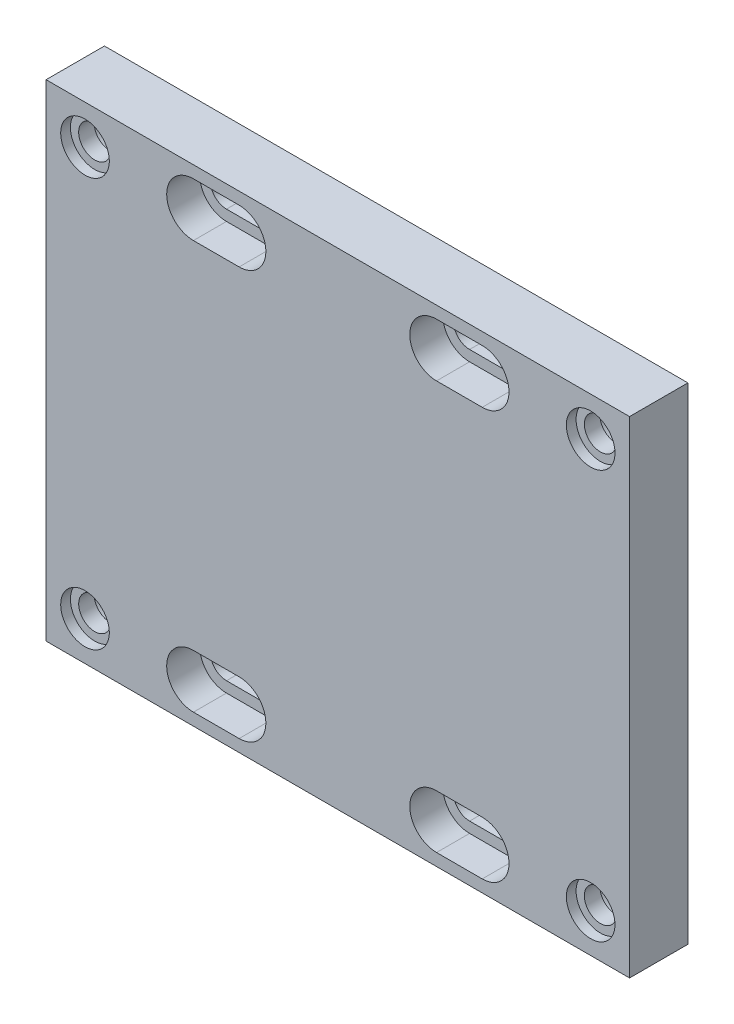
ISO-10303-21;
HEADER;
FILE_DESCRIPTION(('STEP AP214'),'2;1');
FILE_NAME('part.step','',(''),(''),'','','');
FILE_SCHEMA(('AUTOMOTIVE_DESIGN { 1 0 10303 214 1 1 1 1 }'));
ENDSEC;
DATA;
#1=APPLICATION_CONTEXT('core data for automotive mechanical design processes');
#2=APPLICATION_PROTOCOL_DEFINITION('international standard','automotive_design',2000,#1);
#3=PRODUCT_CONTEXT('',#1,'mechanical');
#4=PRODUCT('Part','Part','',(#3));
#5=PRODUCT_RELATED_PRODUCT_CATEGORY('part','',(#4));
#6=PRODUCT_DEFINITION_FORMATION('','',#4);
#7=PRODUCT_DEFINITION_CONTEXT('part definition',#1,'design');
#8=PRODUCT_DEFINITION('design','',#6,#7);
#9=PRODUCT_DEFINITION_SHAPE('','',#8);
#10=(LENGTH_UNIT() NAMED_UNIT(*) SI_UNIT(.MILLI.,.METRE.));
#11=(NAMED_UNIT(*) PLANE_ANGLE_UNIT() SI_UNIT($,.RADIAN.));
#12=(NAMED_UNIT(*) SI_UNIT($,.STERADIAN.) SOLID_ANGLE_UNIT());
#13=UNCERTAINTY_MEASURE_WITH_UNIT(LENGTH_MEASURE(1.E-05),#10,'distance_accuracy_value','');
#14=(GEOMETRIC_REPRESENTATION_CONTEXT(3) GLOBAL_UNCERTAINTY_ASSIGNED_CONTEXT((#13)) GLOBAL_UNIT_ASSIGNED_CONTEXT((#10,
#11,#12)) REPRESENTATION_CONTEXT('',''));
#15=CARTESIAN_POINT('',(0.,0.,0.));
#16=DIRECTION('',(0.,0.,1.));
#17=DIRECTION('',(1.,0.,0.));
#18=AXIS2_PLACEMENT_3D('',#15,#16,#17);
#19=CARTESIAN_POINT('',(-343.662294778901,66.7263282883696,0.));
#20=DIRECTION('',(0.,0.,-1.));
#21=DIRECTION('',(-1.,0.,0.));
#22=AXIS2_PLACEMENT_3D('',#19,#20,#21);
#23=CYLINDRICAL_SURFACE('',#22,3.3);
#24=CARTESIAN_POINT('',(-343.662294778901,66.7263282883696,6.8));
#25=DIRECTION('',(0.,0.,-1.));
#26=DIRECTION('',(-1.,0.,0.));
#27=AXIS2_PLACEMENT_3D('',#24,#25,#26);
#28=CIRCLE('',#27,3.3);
#29=CARTESIAN_POINT('',(-346.962294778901,66.7263282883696,6.8));
#30=VERTEX_POINT('',#29);
#31=EDGE_CURVE('E534',#30,#30,#28,.T.);
#32=ORIENTED_EDGE('',*,*,#31,.T.);
#33=EDGE_LOOP('',(#32));
#34=FACE_BOUND('',#33,.T.);
#35=CARTESIAN_POINT('',(-343.662294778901,66.7263282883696,10.));
#36=DIRECTION('',(0.,0.,1.));
#37=DIRECTION('',(1.,0.,0.));
#38=AXIS2_PLACEMENT_3D('',#35,#36,#37);
#39=CIRCLE('',#38,3.3);
#40=CARTESIAN_POINT('',(-340.362294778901,66.7263282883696,10.));
#41=VERTEX_POINT('',#40);
#42=EDGE_CURVE('E517',#41,#41,#39,.F.);
#43=ORIENTED_EDGE('',*,*,#42,.F.);
#44=EDGE_LOOP('',(#43));
#45=FACE_BOUND('',#44,.T.);
#46=ADVANCED_FACE('F16',(#34,#45),#23,.F.);
#47=CARTESIAN_POINT('',(-343.662294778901,150.72632828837,0.));
#48=DIRECTION('',(0.,0.,-1.));
#49=DIRECTION('',(-1.,0.,0.));
#50=AXIS2_PLACEMENT_3D('',#47,#48,#49);
#51=CYLINDRICAL_SURFACE('',#50,3.3);
#52=CARTESIAN_POINT('',(-343.662294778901,150.72632828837,6.8));
#53=DIRECTION('',(0.,0.,-1.));
#54=DIRECTION('',(-1.,0.,0.));
#55=AXIS2_PLACEMENT_3D('',#52,#53,#54);
#56=CIRCLE('',#55,3.3);
#57=CARTESIAN_POINT('',(-346.962294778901,150.72632828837,6.8));
#58=VERTEX_POINT('',#57);
#59=EDGE_CURVE('E543',#58,#58,#56,.T.);
#60=ORIENTED_EDGE('',*,*,#59,.T.);
#61=EDGE_LOOP('',(#60));
#62=FACE_BOUND('',#61,.T.);
#63=CARTESIAN_POINT('',(-343.662294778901,150.72632828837,10.));
#64=DIRECTION('',(0.,0.,1.));
#65=DIRECTION('',(1.,0.,0.));
#66=AXIS2_PLACEMENT_3D('',#63,#64,#65);
#67=CIRCLE('',#66,3.3);
#68=CARTESIAN_POINT('',(-340.362294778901,150.72632828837,10.));
#69=VERTEX_POINT('',#68);
#70=EDGE_CURVE('E524',#69,#69,#67,.F.);
#71=ORIENTED_EDGE('',*,*,#70,.F.);
#72=EDGE_LOOP('',(#71));
#73=FACE_BOUND('',#72,.T.);
#74=ADVANCED_FACE('F619',(#62,#73),#51,.F.);
#75=CARTESIAN_POINT('',(-335.662294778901,158.72632828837,12.));
#76=DIRECTION('',(-1.,0.,0.));
#77=DIRECTION('',(0.,0.,1.));
#78=AXIS2_PLACEMENT_3D('',#75,#76,#77);
#79=PLANE('',#78);
#80=DIRECTION('',(0.,1.,0.));
#81=VECTOR('',#80,1.);
#82=CARTESIAN_POINT('',(-335.662294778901,158.72632828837,0.));
#83=LINE('',#82,#81);
#84=CARTESIAN_POINT('',(-335.662294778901,58.7263282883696,0.));
#85=VERTEX_POINT('',#84);
#86=CARTESIAN_POINT('',(-335.662294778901,158.72632828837,0.));
#87=VERTEX_POINT('',#86);
#88=EDGE_CURVE('E564',#85,#87,#83,.T.);
#89=ORIENTED_EDGE('',*,*,#88,.T.);
#90=DIRECTION('',(0.,0.,-1.));
#91=VECTOR('',#90,1.);
#92=CARTESIAN_POINT('',(-335.662294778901,158.72632828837,12.));
#93=LINE('',#92,#91);
#94=CARTESIAN_POINT('',(-335.662294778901,158.72632828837,12.));
#95=VERTEX_POINT('',#94);
#96=EDGE_CURVE('E11',#95,#87,#93,.T.);
#97=ORIENTED_EDGE('',*,*,#96,.F.);
#98=DIRECTION('',(0.,1.,0.));
#99=VECTOR('',#98,1.);
#100=CARTESIAN_POINT('',(-335.662294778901,158.72632828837,12.));
#101=LINE('',#100,#99);
#102=CARTESIAN_POINT('',(-335.662294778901,58.7263282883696,12.));
#103=VERTEX_POINT('',#102);
#104=EDGE_CURVE('E565',#103,#95,#101,.T.);
#105=ORIENTED_EDGE('',*,*,#104,.F.);
#106=DIRECTION('',(0.,0.,-1.));
#107=VECTOR('',#106,1.);
#108=CARTESIAN_POINT('',(-335.662294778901,58.7263282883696,12.));
#109=LINE('',#108,#107);
#110=EDGE_CURVE('E575',#103,#85,#109,.T.);
#111=ORIENTED_EDGE('',*,*,#110,.T.);
#112=EDGE_LOOP('',(#89,#97,#105,#111));
#113=FACE_BOUND('',#112,.T.);
#114=ADVANCED_FACE('F18',(#113),#79,.F.);
#115=CARTESIAN_POINT('',(-455.662294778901,158.72632828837,12.));
#116=DIRECTION('',(0.,-1.,0.));
#117=DIRECTION('',(0.,0.,-1.));
#118=AXIS2_PLACEMENT_3D('',#115,#116,#117);
#119=PLANE('',#118);
#120=DIRECTION('',(-1.,0.,0.));
#121=VECTOR('',#120,1.);
#122=CARTESIAN_POINT('',(-455.662294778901,158.72632828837,0.));
#123=LINE('',#122,#121);
#124=CARTESIAN_POINT('',(-455.662294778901,158.72632828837,0.));
#125=VERTEX_POINT('',#124);
#126=EDGE_CURVE('E578',#87,#125,#123,.T.);
#127=ORIENTED_EDGE('',*,*,#126,.T.);
#128=DIRECTION('',(0.,0.,-1.));
#129=VECTOR('',#128,1.);
#130=CARTESIAN_POINT('',(-455.662294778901,158.72632828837,12.));
#131=LINE('',#130,#129);
#132=CARTESIAN_POINT('',(-455.662294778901,158.72632828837,12.));
#133=VERTEX_POINT('',#132);
#134=EDGE_CURVE('E25',#133,#125,#131,.T.);
#135=ORIENTED_EDGE('',*,*,#134,.F.);
#136=DIRECTION('',(-1.,0.,0.));
#137=VECTOR('',#136,1.);
#138=CARTESIAN_POINT('',(-455.662294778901,158.72632828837,12.));
#139=LINE('',#138,#137);
#140=EDGE_CURVE('E568',#95,#133,#139,.T.);
#141=ORIENTED_EDGE('',*,*,#140,.F.);
#142=ORIENTED_EDGE('',*,*,#96,.T.);
#143=EDGE_LOOP('',(#127,#135,#141,#142));
#144=FACE_BOUND('',#143,.T.);
#145=ADVANCED_FACE('F675',(#144),#119,.F.);
#146=CARTESIAN_POINT('',(-455.662294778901,158.72632828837,12.));
#147=DIRECTION('',(1.,0.,0.));
#148=DIRECTION('',(0.,0.,-1.));
#149=AXIS2_PLACEMENT_3D('',#146,#147,#148);
#150=PLANE('',#149);
#151=DIRECTION('',(0.,-1.,0.));
#152=VECTOR('',#151,1.);
#153=CARTESIAN_POINT('',(-455.662294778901,158.72632828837,0.));
#154=LINE('',#153,#152);
#155=CARTESIAN_POINT('',(-455.662294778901,58.7263282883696,0.));
#156=VERTEX_POINT('',#155);
#157=EDGE_CURVE('E580',#125,#156,#154,.T.);
#158=ORIENTED_EDGE('',*,*,#157,.T.);
#159=DIRECTION('',(0.,0.,-1.));
#160=VECTOR('',#159,1.);
#161=CARTESIAN_POINT('',(-455.662294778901,58.7263282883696,12.));
#162=LINE('',#161,#160);
#163=CARTESIAN_POINT('',(-455.662294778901,58.7263282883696,12.));
#164=VERTEX_POINT('',#163);
#165=EDGE_CURVE('E585',#164,#156,#162,.T.);
#166=ORIENTED_EDGE('',*,*,#165,.F.);
#167=DIRECTION('',(0.,-1.,0.));
#168=VECTOR('',#167,1.);
#169=CARTESIAN_POINT('',(-455.662294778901,158.72632828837,12.));
#170=LINE('',#169,#168);
#171=EDGE_CURVE('E571',#133,#164,#170,.T.);
#172=ORIENTED_EDGE('',*,*,#171,.F.);
#173=ORIENTED_EDGE('',*,*,#134,.T.);
#174=EDGE_LOOP('',(#158,#166,#172,#173));
#175=FACE_BOUND('',#174,.T.);
#176=ADVANCED_FACE('F672',(#175),#150,.F.);
#177=CARTESIAN_POINT('',(-455.662294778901,58.7263282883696,12.));
#178=DIRECTION('',(0.,1.,0.));
#179=DIRECTION('',(0.,0.,1.));
#180=AXIS2_PLACEMENT_3D('',#177,#178,#179);
#181=PLANE('',#180);
#182=DIRECTION('',(1.,0.,0.));
#183=VECTOR('',#182,1.);
#184=CARTESIAN_POINT('',(-455.662294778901,58.7263282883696,0.));
#185=LINE('',#184,#183);
#186=EDGE_CURVE('E569',#156,#85,#185,.T.);
#187=ORIENTED_EDGE('',*,*,#186,.T.);
#188=ORIENTED_EDGE('',*,*,#110,.F.);
#189=DIRECTION('',(1.,0.,0.));
#190=VECTOR('',#189,1.);
#191=CARTESIAN_POINT('',(-455.662294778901,58.7263282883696,12.));
#192=LINE('',#191,#190);
#193=EDGE_CURVE('E573',#164,#103,#192,.T.);
#194=ORIENTED_EDGE('',*,*,#193,.F.);
#195=ORIENTED_EDGE('',*,*,#165,.T.);
#196=EDGE_LOOP('',(#187,#188,#194,#195));
#197=FACE_BOUND('',#196,.T.);
#198=ADVANCED_FACE('F666',(#197),#181,.F.);
#199=CARTESIAN_POINT('',(0.,0.,12.));
#200=DIRECTION('',(0.,0.,1.));
#201=DIRECTION('',(1.,0.,0.));
#202=AXIS2_PLACEMENT_3D('',#199,#200,#201);
#203=PLANE('',#202);
#204=DIRECTION('',(1.,0.,0.));
#205=VECTOR('',#204,1.);
#206=CARTESIAN_POINT('',(-375.362294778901,145.22632828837,12.));
#207=LINE('',#206,#205);
#208=CARTESIAN_POINT('',(-375.362294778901,145.22632828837,12.));
#209=VERTEX_POINT('',#208);
#210=CARTESIAN_POINT('',(-365.962294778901,145.22632828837,12.));
#211=VERTEX_POINT('',#210);
#212=EDGE_CURVE('E278',#209,#211,#207,.T.);
#213=ORIENTED_EDGE('',*,*,#212,.F.);
#214=CARTESIAN_POINT('',(-375.362294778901,150.72632828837,12.));
#215=DIRECTION('',(0.,0.,1.));
#216=DIRECTION('',(1.,0.,0.));
#217=AXIS2_PLACEMENT_3D('',#214,#215,#216);
#218=CIRCLE('',#217,5.5);
#219=CARTESIAN_POINT('',(-375.362294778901,156.22632828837,12.));
#220=VERTEX_POINT('',#219);
#221=EDGE_CURVE('E269',#220,#209,#218,.T.);
#222=ORIENTED_EDGE('',*,*,#221,.F.);
#223=DIRECTION('',(1.,0.,0.));
#224=VECTOR('',#223,1.);
#225=CARTESIAN_POINT('',(-375.362294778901,156.22632828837,12.));
#226=LINE('',#225,#224);
#227=CARTESIAN_POINT('',(-365.962294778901,156.22632828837,12.));
#228=VERTEX_POINT('',#227);
#229=EDGE_CURVE('E254',#220,#228,#226,.T.);
#230=ORIENTED_EDGE('',*,*,#229,.T.);
#231=CARTESIAN_POINT('',(-365.962294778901,150.72632828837,12.));
#232=DIRECTION('',(0.,0.,1.));
#233=DIRECTION('',(1.,0.,0.));
#234=AXIS2_PLACEMENT_3D('',#231,#232,#233);
#235=CIRCLE('',#234,5.5);
#236=EDGE_CURVE('E33',#211,#228,#235,.T.);
#237=ORIENTED_EDGE('',*,*,#236,.F.);
#238=EDGE_LOOP('',(#213,#222,#230,#237));
#239=FACE_BOUND('',#238,.T.);
#240=DIRECTION('',(1.,0.,0.));
#241=VECTOR('',#240,1.);
#242=CARTESIAN_POINT('',(-425.362294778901,156.22632828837,12.));
#243=LINE('',#242,#241);
#244=CARTESIAN_POINT('',(-425.362294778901,156.22632828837,12.));
#245=VERTEX_POINT('',#244);
#246=CARTESIAN_POINT('',(-415.962294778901,156.22632828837,12.));
#247=VERTEX_POINT('',#246);
#248=EDGE_CURVE('E326',#245,#247,#243,.T.);
#249=ORIENTED_EDGE('',*,*,#248,.T.);
#250=CARTESIAN_POINT('',(-415.962294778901,150.72632828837,12.));
#251=DIRECTION('',(0.,0.,1.));
#252=DIRECTION('',(1.,0.,0.));
#253=AXIS2_PLACEMENT_3D('',#250,#251,#252);
#254=CIRCLE('',#253,5.5);
#255=CARTESIAN_POINT('',(-415.962294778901,145.22632828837,12.));
#256=VERTEX_POINT('',#255);
#257=EDGE_CURVE('E356',#256,#247,#254,.T.);
#258=ORIENTED_EDGE('',*,*,#257,.F.);
#259=DIRECTION('',(1.,0.,0.));
#260=VECTOR('',#259,1.);
#261=CARTESIAN_POINT('',(-425.3622947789,145.22632828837,12.));
#262=LINE('',#261,#260);
#263=CARTESIAN_POINT('',(-425.362294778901,145.22632828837,12.));
#264=VERTEX_POINT('',#263);
#265=EDGE_CURVE('E309',#264,#256,#262,.T.);
#266=ORIENTED_EDGE('',*,*,#265,.F.);
#267=CARTESIAN_POINT('',(-425.3622947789,150.72632828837,12.));
#268=DIRECTION('',(0.,0.,1.));
#269=DIRECTION('',(1.,0.,0.));
#270=AXIS2_PLACEMENT_3D('',#267,#268,#269);
#271=CIRCLE('',#270,5.5);
#272=EDGE_CURVE('E334',#245,#264,#271,.T.);
#273=ORIENTED_EDGE('',*,*,#272,.F.);
#274=EDGE_LOOP('',(#249,#258,#266,#273));
#275=FACE_BOUND('',#274,.T.);
#276=DIRECTION('',(1.,0.,0.));
#277=VECTOR('',#276,1.);
#278=CARTESIAN_POINT('',(-375.362294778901,61.2263282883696,12.));
#279=LINE('',#278,#277);
#280=CARTESIAN_POINT('',(-375.362294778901,61.2263282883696,12.));
#281=VERTEX_POINT('',#280);
#282=CARTESIAN_POINT('',(-365.962294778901,61.2263282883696,12.));
#283=VERTEX_POINT('',#282);
#284=EDGE_CURVE('E373',#281,#283,#279,.T.);
#285=ORIENTED_EDGE('',*,*,#284,.F.);
#286=CARTESIAN_POINT('',(-375.362294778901,66.7263282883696,12.));
#287=DIRECTION('',(0.,0.,1.));
#288=DIRECTION('',(1.,0.,0.));
#289=AXIS2_PLACEMENT_3D('',#286,#287,#288);
#290=CIRCLE('',#289,5.5);
#291=CARTESIAN_POINT('',(-375.362294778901,72.2263282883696,12.));
#292=VERTEX_POINT('',#291);
#293=EDGE_CURVE('E398',#292,#281,#290,.T.);
#294=ORIENTED_EDGE('',*,*,#293,.F.);
#295=DIRECTION('',(1.,0.,0.));
#296=VECTOR('',#295,1.);
#297=CARTESIAN_POINT('',(-375.362294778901,72.2263282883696,12.));
#298=LINE('',#297,#296);
#299=CARTESIAN_POINT('',(-365.962294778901,72.2263282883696,12.));
#300=VERTEX_POINT('',#299);
#301=EDGE_CURVE('E390',#292,#300,#298,.T.);
#302=ORIENTED_EDGE('',*,*,#301,.T.);
#303=CARTESIAN_POINT('',(-365.962294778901,66.7263282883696,12.));
#304=DIRECTION('',(0.,0.,1.));
#305=DIRECTION('',(1.,0.,0.));
#306=AXIS2_PLACEMENT_3D('',#303,#304,#305);
#307=CIRCLE('',#306,5.5);
#308=EDGE_CURVE('E420',#283,#300,#307,.T.);
#309=ORIENTED_EDGE('',*,*,#308,.F.);
#310=EDGE_LOOP('',(#285,#294,#302,#309));
#311=FACE_BOUND('',#310,.T.);
#312=DIRECTION('',(1.,0.,0.));
#313=VECTOR('',#312,1.);
#314=CARTESIAN_POINT('',(-425.362294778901,72.2263282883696,12.));
#315=LINE('',#314,#313);
#316=CARTESIAN_POINT('',(-425.362294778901,72.2263282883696,12.));
#317=VERTEX_POINT('',#316);
#318=CARTESIAN_POINT('',(-415.962294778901,72.2263282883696,12.));
#319=VERTEX_POINT('',#318);
#320=EDGE_CURVE('E454',#317,#319,#315,.T.);
#321=ORIENTED_EDGE('',*,*,#320,.T.);
#322=CARTESIAN_POINT('',(-415.962294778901,66.7263282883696,12.));
#323=DIRECTION('',(0.,0.,1.));
#324=DIRECTION('',(1.,0.,0.));
#325=AXIS2_PLACEMENT_3D('',#322,#323,#324);
#326=CIRCLE('',#325,5.5);
#327=CARTESIAN_POINT('',(-415.962294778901,61.2263282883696,12.));
#328=VERTEX_POINT('',#327);
#329=EDGE_CURVE('E484',#328,#319,#326,.T.);
#330=ORIENTED_EDGE('',*,*,#329,.F.);
#331=DIRECTION('',(1.,0.,0.));
#332=VECTOR('',#331,1.);
#333=CARTESIAN_POINT('',(-425.3622947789,61.2263282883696,12.));
#334=LINE('',#333,#332);
#335=CARTESIAN_POINT('',(-425.362294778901,61.2263282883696,12.));
#336=VERTEX_POINT('',#335);
#337=EDGE_CURVE('E437',#336,#328,#334,.T.);
#338=ORIENTED_EDGE('',*,*,#337,.F.);
#339=CARTESIAN_POINT('',(-425.3622947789,66.7263282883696,12.));
#340=DIRECTION('',(0.,0.,1.));
#341=DIRECTION('',(1.,0.,0.));
#342=AXIS2_PLACEMENT_3D('',#339,#340,#341);
#343=CIRCLE('',#342,5.5);
#344=EDGE_CURVE('E462',#317,#336,#343,.T.);
#345=ORIENTED_EDGE('',*,*,#344,.F.);
#346=EDGE_LOOP('',(#321,#330,#338,#345));
#347=FACE_BOUND('',#346,.T.);
#348=CARTESIAN_POINT('',(-447.662294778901,150.72632828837,12.));
#349=DIRECTION('',(0.,0.,1.));
#350=DIRECTION('',(-1.,0.,0.));
#351=AXIS2_PLACEMENT_3D('',#348,#349,#350);
#352=CIRCLE('',#351,5.);
#353=CARTESIAN_POINT('',(-452.662294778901,150.72632828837,12.));
#354=VERTEX_POINT('',#353);
#355=EDGE_CURVE('E501',#354,#354,#352,.T.);
#356=ORIENTED_EDGE('',*,*,#355,.F.);
#357=EDGE_LOOP('',(#356));
#358=FACE_BOUND('',#357,.T.);
#359=CARTESIAN_POINT('',(-447.662294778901,66.7263282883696,12.));
#360=DIRECTION('',(0.,0.,1.));
#361=DIRECTION('',(-1.,0.,0.));
#362=AXIS2_PLACEMENT_3D('',#359,#360,#361);
#363=CIRCLE('',#362,5.);
#364=CARTESIAN_POINT('',(-452.662294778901,66.7263282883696,12.));
#365=VERTEX_POINT('',#364);
#366=EDGE_CURVE('E511',#365,#365,#363,.T.);
#367=ORIENTED_EDGE('',*,*,#366,.F.);
#368=EDGE_LOOP('',(#367));
#369=FACE_BOUND('',#368,.T.);
#370=CARTESIAN_POINT('',(-343.662294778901,66.7263282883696,12.));
#371=DIRECTION('',(0.,0.,1.));
#372=DIRECTION('',(1.,0.,0.));
#373=AXIS2_PLACEMENT_3D('',#370,#371,#372);
#374=CIRCLE('',#373,5.);
#375=CARTESIAN_POINT('',(-338.662294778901,66.7263282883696,12.));
#376=VERTEX_POINT('',#375);
#377=EDGE_CURVE('E518',#376,#376,#374,.T.);
#378=ORIENTED_EDGE('',*,*,#377,.F.);
#379=EDGE_LOOP('',(#378));
#380=FACE_BOUND('',#379,.T.);
#381=CARTESIAN_POINT('',(-343.662294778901,150.72632828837,12.));
#382=DIRECTION('',(0.,0.,1.));
#383=DIRECTION('',(1.,0.,0.));
#384=AXIS2_PLACEMENT_3D('',#381,#382,#383);
#385=CIRCLE('',#384,5.);
#386=CARTESIAN_POINT('',(-338.662294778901,150.72632828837,12.));
#387=VERTEX_POINT('',#386);
#388=EDGE_CURVE('E525',#387,#387,#385,.T.);
#389=ORIENTED_EDGE('',*,*,#388,.F.);
#390=EDGE_LOOP('',(#389));
#391=FACE_BOUND('',#390,.T.);
#392=ORIENTED_EDGE('',*,*,#104,.T.);
#393=ORIENTED_EDGE('',*,*,#140,.T.);
#394=ORIENTED_EDGE('',*,*,#171,.T.);
#395=ORIENTED_EDGE('',*,*,#193,.T.);
#396=EDGE_LOOP('',(#392,#393,#394,#395));
#397=FACE_BOUND('',#396,.T.);
#398=ADVANCED_FACE('F276',(#239,#275,#311,#347,#358,#369,#380,#391,#397),#203,.T.);
#399=CARTESIAN_POINT('',(0.,0.,0.));
#400=DIRECTION('',(0.,0.,1.));
#401=DIRECTION('',(1.,0.,0.));
#402=AXIS2_PLACEMENT_3D('',#399,#400,#401);
#403=PLANE('',#402);
#404=DIRECTION('',(1.,0.,0.));
#405=VECTOR('',#404,1.);
#406=CARTESIAN_POINT('',(-375.362294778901,154.02632828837,0.));
#407=LINE('',#406,#405);
#408=CARTESIAN_POINT('',(-375.362294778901,154.02632828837,0.));
#409=VERTEX_POINT('',#408);
#410=CARTESIAN_POINT('',(-365.962294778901,154.02632828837,0.));
#411=VERTEX_POINT('',#410);
#412=EDGE_CURVE('E1265',#409,#411,#407,.T.);
#413=ORIENTED_EDGE('',*,*,#412,.F.);
#414=CARTESIAN_POINT('',(-375.362294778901,150.72632828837,0.));
#415=DIRECTION('',(0.,0.,1.));
#416=DIRECTION('',(1.,0.,0.));
#417=AXIS2_PLACEMENT_3D('',#414,#415,#416);
#418=CIRCLE('',#417,3.3);
#419=CARTESIAN_POINT('',(-375.362294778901,147.42632828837,0.));
#420=VERTEX_POINT('',#419);
#421=EDGE_CURVE('E288',#409,#420,#418,.T.);
#422=ORIENTED_EDGE('',*,*,#421,.T.);
#423=DIRECTION('',(1.,0.,0.));
#424=VECTOR('',#423,1.);
#425=CARTESIAN_POINT('',(-375.362294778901,147.42632828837,0.));
#426=LINE('',#425,#424);
#427=CARTESIAN_POINT('',(-365.962294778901,147.42632828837,0.));
#428=VERTEX_POINT('',#427);
#429=EDGE_CURVE('E1259',#420,#428,#426,.T.);
#430=ORIENTED_EDGE('',*,*,#429,.T.);
#431=CARTESIAN_POINT('',(-365.962294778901,150.72632828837,0.));
#432=DIRECTION('',(0.,0.,1.));
#433=DIRECTION('',(1.,0.,0.));
#434=AXIS2_PLACEMENT_3D('',#431,#432,#433);
#435=CIRCLE('',#434,3.3);
#436=EDGE_CURVE('E302',#428,#411,#435,.T.);
#437=ORIENTED_EDGE('',*,*,#436,.T.);
#438=EDGE_LOOP('',(#413,#422,#430,#437));
#439=FACE_BOUND('',#438,.T.);
#440=DIRECTION('',(1.,0.,0.));
#441=VECTOR('',#440,1.);
#442=CARTESIAN_POINT('',(-425.362294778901,154.02632828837,0.));
#443=LINE('',#442,#441);
#444=CARTESIAN_POINT('',(-425.362294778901,154.02632828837,0.));
#445=VERTEX_POINT('',#444);
#446=CARTESIAN_POINT('',(-415.962294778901,154.02632828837,0.));
#447=VERTEX_POINT('',#446);
#448=EDGE_CURVE('E320',#445,#447,#443,.T.);
#449=ORIENTED_EDGE('',*,*,#448,.F.);
#450=CARTESIAN_POINT('',(-425.3622947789,150.72632828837,0.));
#451=DIRECTION('',(0.,0.,1.));
#452=DIRECTION('',(1.,0.,0.));
#453=AXIS2_PLACEMENT_3D('',#450,#451,#452);
#454=CIRCLE('',#453,3.3);
#455=CARTESIAN_POINT('',(-425.362294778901,147.42632828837,0.));
#456=VERTEX_POINT('',#455);
#457=EDGE_CURVE('E342',#445,#456,#454,.T.);
#458=ORIENTED_EDGE('',*,*,#457,.T.);
#459=DIRECTION('',(1.,0.,0.));
#460=VECTOR('',#459,1.);
#461=CARTESIAN_POINT('',(-425.362294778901,147.42632828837,0.));
#462=LINE('',#461,#460);
#463=CARTESIAN_POINT('',(-415.962294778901,147.42632828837,0.));
#464=VERTEX_POINT('',#463);
#465=EDGE_CURVE('E317',#456,#464,#462,.T.);
#466=ORIENTED_EDGE('',*,*,#465,.T.);
#467=CARTESIAN_POINT('',(-415.962294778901,150.72632828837,0.));
#468=DIRECTION('',(0.,0.,1.));
#469=DIRECTION('',(1.,0.,0.));
#470=AXIS2_PLACEMENT_3D('',#467,#468,#469);
#471=CIRCLE('',#470,3.3);
#472=EDGE_CURVE('E365',#464,#447,#471,.T.);
#473=ORIENTED_EDGE('',*,*,#472,.T.);
#474=EDGE_LOOP('',(#449,#458,#466,#473));
#475=FACE_BOUND('',#474,.T.);
#476=DIRECTION('',(1.,0.,0.));
#477=VECTOR('',#476,1.);
#478=CARTESIAN_POINT('',(-375.362294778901,70.0263282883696,0.));
#479=LINE('',#478,#477);
#480=CARTESIAN_POINT('',(-375.362294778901,70.0263282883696,0.));
#481=VERTEX_POINT('',#480);
#482=CARTESIAN_POINT('',(-365.962294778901,70.0263282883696,0.));
#483=VERTEX_POINT('',#482);
#484=EDGE_CURVE('E384',#481,#483,#479,.T.);
#485=ORIENTED_EDGE('',*,*,#484,.F.);
#486=CARTESIAN_POINT('',(-375.362294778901,66.7263282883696,0.));
#487=DIRECTION('',(0.,0.,1.));
#488=DIRECTION('',(1.,0.,0.));
#489=AXIS2_PLACEMENT_3D('',#486,#487,#488);
#490=CIRCLE('',#489,3.3);
#491=CARTESIAN_POINT('',(-375.362294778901,63.4263282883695,0.));
#492=VERTEX_POINT('',#491);
#493=EDGE_CURVE('E407',#481,#492,#490,.T.);
#494=ORIENTED_EDGE('',*,*,#493,.T.);
#495=DIRECTION('',(1.,0.,0.));
#496=VECTOR('',#495,1.);
#497=CARTESIAN_POINT('',(-375.362294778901,63.4263282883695,0.));
#498=LINE('',#497,#496);
#499=CARTESIAN_POINT('',(-365.962294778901,63.4263282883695,0.));
#500=VERTEX_POINT('',#499);
#501=EDGE_CURVE('E381',#492,#500,#498,.T.);
#502=ORIENTED_EDGE('',*,*,#501,.T.);
#503=CARTESIAN_POINT('',(-365.962294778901,66.7263282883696,0.));
#504=DIRECTION('',(0.,0.,1.));
#505=DIRECTION('',(1.,0.,0.));
#506=AXIS2_PLACEMENT_3D('',#503,#504,#505);
#507=CIRCLE('',#506,3.3);
#508=EDGE_CURVE('E428',#500,#483,#507,.T.);
#509=ORIENTED_EDGE('',*,*,#508,.T.);
#510=EDGE_LOOP('',(#485,#494,#502,#509));
#511=FACE_BOUND('',#510,.T.);
#512=CARTESIAN_POINT('',(-415.962294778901,66.7263282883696,0.));
#513=DIRECTION('',(0.,0.,1.));
#514=DIRECTION('',(1.,0.,0.));
#515=AXIS2_PLACEMENT_3D('',#512,#513,#514);
#516=CIRCLE('',#515,3.3);
#517=CARTESIAN_POINT('',(-415.962294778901,63.4263282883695,0.));
#518=VERTEX_POINT('',#517);
#519=CARTESIAN_POINT('',(-415.962294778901,70.0263282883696,0.));
#520=VERTEX_POINT('',#519);
#521=EDGE_CURVE('E493',#518,#520,#516,.T.);
#522=ORIENTED_EDGE('',*,*,#521,.T.);
#523=DIRECTION('',(1.,0.,0.));
#524=VECTOR('',#523,1.);
#525=CARTESIAN_POINT('',(-425.362294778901,70.0263282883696,0.));
#526=LINE('',#525,#524);
#527=CARTESIAN_POINT('',(-425.362294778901,70.0263282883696,0.));
#528=VERTEX_POINT('',#527);
#529=EDGE_CURVE('E448',#528,#520,#526,.T.);
#530=ORIENTED_EDGE('',*,*,#529,.F.);
#531=CARTESIAN_POINT('',(-425.3622947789,66.7263282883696,0.));
#532=DIRECTION('',(0.,0.,1.));
#533=DIRECTION('',(1.,0.,0.));
#534=AXIS2_PLACEMENT_3D('',#531,#532,#533);
#535=CIRCLE('',#534,3.3);
#536=CARTESIAN_POINT('',(-425.362294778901,63.4263282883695,0.));
#537=VERTEX_POINT('',#536);
#538=EDGE_CURVE('E470',#528,#537,#535,.T.);
#539=ORIENTED_EDGE('',*,*,#538,.T.);
#540=DIRECTION('',(1.,0.,0.));
#541=VECTOR('',#540,1.);
#542=CARTESIAN_POINT('',(-425.362294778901,63.4263282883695,0.));
#543=LINE('',#542,#541);
#544=EDGE_CURVE('E445',#537,#518,#543,.T.);
#545=ORIENTED_EDGE('',*,*,#544,.T.);
#546=EDGE_LOOP('',(#522,#530,#539,#545));
#547=FACE_BOUND('',#546,.T.);
#548=CARTESIAN_POINT('',(-343.662294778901,66.7263282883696,0.));
#549=DIRECTION('',(0.,0.,-1.));
#550=DIRECTION('',(-1.,0.,0.));
#551=AXIS2_PLACEMENT_3D('',#548,#549,#550);
#552=CIRCLE('',#551,5.5);
#553=CARTESIAN_POINT('',(-349.162294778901,66.7263282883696,0.));
#554=VERTEX_POINT('',#553);
#555=EDGE_CURVE('E528',#554,#554,#552,.T.);
#556=ORIENTED_EDGE('',*,*,#555,.F.);
#557=EDGE_LOOP('',(#556));
#558=FACE_BOUND('',#557,.T.);
#559=CARTESIAN_POINT('',(-343.662294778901,150.72632828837,0.));
#560=DIRECTION('',(0.,0.,-1.));
#561=DIRECTION('',(-1.,0.,0.));
#562=AXIS2_PLACEMENT_3D('',#559,#560,#561);
#563=CIRCLE('',#562,5.5);
#564=CARTESIAN_POINT('',(-349.162294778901,150.72632828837,0.));
#565=VERTEX_POINT('',#564);
#566=EDGE_CURVE('E537',#565,#565,#563,.T.);
#567=ORIENTED_EDGE('',*,*,#566,.F.);
#568=EDGE_LOOP('',(#567));
#569=FACE_BOUND('',#568,.T.);
#570=CARTESIAN_POINT('',(-447.662294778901,150.72632828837,0.));
#571=DIRECTION('',(0.,0.,-1.));
#572=DIRECTION('',(-1.,0.,0.));
#573=AXIS2_PLACEMENT_3D('',#570,#571,#572);
#574=CIRCLE('',#573,5.5);
#575=CARTESIAN_POINT('',(-453.162294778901,150.72632828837,0.));
#576=VERTEX_POINT('',#575);
#577=EDGE_CURVE('E546',#576,#576,#574,.T.);
#578=ORIENTED_EDGE('',*,*,#577,.F.);
#579=EDGE_LOOP('',(#578));
#580=FACE_BOUND('',#579,.T.);
#581=CARTESIAN_POINT('',(-447.662294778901,66.7263282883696,0.));
#582=DIRECTION('',(0.,0.,-1.));
#583=DIRECTION('',(-1.,0.,0.));
#584=AXIS2_PLACEMENT_3D('',#581,#582,#583);
#585=CIRCLE('',#584,5.5);
#586=CARTESIAN_POINT('',(-453.162294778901,66.7263282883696,0.));
#587=VERTEX_POINT('',#586);
#588=EDGE_CURVE('E555',#587,#587,#585,.T.);
#589=ORIENTED_EDGE('',*,*,#588,.F.);
#590=EDGE_LOOP('',(#589));
#591=FACE_BOUND('',#590,.T.);
#592=ORIENTED_EDGE('',*,*,#88,.F.);
#593=ORIENTED_EDGE('',*,*,#186,.F.);
#594=ORIENTED_EDGE('',*,*,#157,.F.);
#595=ORIENTED_EDGE('',*,*,#126,.F.);
#596=EDGE_LOOP('',(#592,#593,#594,#595));
#597=FACE_BOUND('',#596,.T.);
#598=ADVANCED_FACE('F663',(#439,#475,#511,#547,#558,#569,#580,#591,#597),#403,.F.);
#599=CARTESIAN_POINT('',(-447.662294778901,66.7263282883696,0.));
#600=DIRECTION('',(0.,0.,-1.));
#601=DIRECTION('',(-1.,0.,0.));
#602=AXIS2_PLACEMENT_3D('',#599,#600,#601);
#603=CYLINDRICAL_SURFACE('',#602,3.3);
#604=CARTESIAN_POINT('',(-447.662294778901,66.7263282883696,10.));
#605=DIRECTION('',(0.,0.,-1.));
#606=DIRECTION('',(-1.,0.,0.));
#607=AXIS2_PLACEMENT_3D('',#604,#605,#606);
#608=CIRCLE('',#607,3.3);
#609=CARTESIAN_POINT('',(-450.962294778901,66.7263282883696,10.));
#610=VERTEX_POINT('',#609);
#611=EDGE_CURVE('E510',#610,#610,#608,.F.);
#612=ORIENTED_EDGE('',*,*,#611,.T.);
#613=EDGE_LOOP('',(#612));
#614=FACE_BOUND('',#613,.T.);
#615=CARTESIAN_POINT('',(-447.662294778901,66.7263282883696,6.8));
#616=DIRECTION('',(0.,0.,-1.));
#617=DIRECTION('',(-1.,0.,0.));
#618=AXIS2_PLACEMENT_3D('',#615,#616,#617);
#619=CIRCLE('',#618,3.3);
#620=CARTESIAN_POINT('',(-450.962294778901,66.7263282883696,6.8));
#621=VERTEX_POINT('',#620);
#622=EDGE_CURVE('E561',#621,#621,#619,.T.);
#623=ORIENTED_EDGE('',*,*,#622,.T.);
#624=EDGE_LOOP('',(#623));
#625=FACE_BOUND('',#624,.T.);
#626=ADVANCED_FACE('F596',(#614,#625),#603,.F.);
#627=CARTESIAN_POINT('',(-444.3622947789,66.7263282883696,6.8));
#628=DIRECTION('',(0.,0.,1.));
#629=DIRECTION('',(1.,0.,0.));
#630=AXIS2_PLACEMENT_3D('',#627,#628,#629);
#631=PLANE('',#630);
#632=ORIENTED_EDGE('',*,*,#622,.F.);
#633=EDGE_LOOP('',(#632));
#634=FACE_BOUND('',#633,.T.);
#635=CARTESIAN_POINT('',(-447.662294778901,66.7263282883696,6.8));
#636=DIRECTION('',(0.,0.,-1.));
#637=DIRECTION('',(-1.,0.,0.));
#638=AXIS2_PLACEMENT_3D('',#635,#636,#637);
#639=CIRCLE('',#638,5.5);
#640=CARTESIAN_POINT('',(-453.162294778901,66.7263282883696,6.8));
#641=VERTEX_POINT('',#640);
#642=EDGE_CURVE('E558',#641,#641,#639,.T.);
#643=ORIENTED_EDGE('',*,*,#642,.T.);
#644=EDGE_LOOP('',(#643));
#645=FACE_BOUND('',#644,.T.);
#646=ADVANCED_FACE('F656',(#634,#645),#631,.F.);
#647=CARTESIAN_POINT('',(-447.662294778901,66.7263282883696,0.));
#648=DIRECTION('',(0.,0.,-1.));
#649=DIRECTION('',(-1.,0.,0.));
#650=AXIS2_PLACEMENT_3D('',#647,#648,#649);
#651=CYLINDRICAL_SURFACE('',#650,5.5);
#652=ORIENTED_EDGE('',*,*,#642,.F.);
#653=EDGE_LOOP('',(#652));
#654=FACE_BOUND('',#653,.T.);
#655=ORIENTED_EDGE('',*,*,#588,.T.);
#656=EDGE_LOOP('',(#655));
#657=FACE_BOUND('',#656,.T.);
#658=ADVANCED_FACE('F652',(#654,#657),#651,.F.);
#659=CARTESIAN_POINT('',(-447.662294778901,150.72632828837,0.));
#660=DIRECTION('',(0.,0.,-1.));
#661=DIRECTION('',(-1.,0.,0.));
#662=AXIS2_PLACEMENT_3D('',#659,#660,#661);
#663=CYLINDRICAL_SURFACE('',#662,3.3);
#664=CARTESIAN_POINT('',(-447.662294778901,150.72632828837,10.));
#665=DIRECTION('',(0.,0.,-1.));
#666=DIRECTION('',(-1.,0.,0.));
#667=AXIS2_PLACEMENT_3D('',#664,#665,#666);
#668=CIRCLE('',#667,3.3);
#669=CARTESIAN_POINT('',(-450.962294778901,150.72632828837,10.));
#670=VERTEX_POINT('',#669);
#671=EDGE_CURVE('E20',#670,#670,#668,.F.);
#672=ORIENTED_EDGE('',*,*,#671,.T.);
#673=EDGE_LOOP('',(#672));
#674=FACE_BOUND('',#673,.T.);
#675=CARTESIAN_POINT('',(-447.662294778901,150.72632828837,6.8));
#676=DIRECTION('',(0.,0.,-1.));
#677=DIRECTION('',(-1.,0.,0.));
#678=AXIS2_PLACEMENT_3D('',#675,#676,#677);
#679=CIRCLE('',#678,3.3);
#680=CARTESIAN_POINT('',(-450.962294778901,150.72632828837,6.8));
#681=VERTEX_POINT('',#680);
#682=EDGE_CURVE('E552',#681,#681,#679,.T.);
#683=ORIENTED_EDGE('',*,*,#682,.T.);
#684=EDGE_LOOP('',(#683));
#685=FACE_BOUND('',#684,.T.);
#686=ADVANCED_FACE('F648',(#674,#685),#663,.F.);
#687=CARTESIAN_POINT('',(-444.3622947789,150.72632828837,6.8));
#688=DIRECTION('',(0.,0.,1.));
#689=DIRECTION('',(1.,0.,0.));
#690=AXIS2_PLACEMENT_3D('',#687,#688,#689);
#691=PLANE('',#690);
#692=ORIENTED_EDGE('',*,*,#682,.F.);
#693=EDGE_LOOP('',(#692));
#694=FACE_BOUND('',#693,.T.);
#695=CARTESIAN_POINT('',(-447.662294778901,150.72632828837,6.8));
#696=DIRECTION('',(0.,0.,-1.));
#697=DIRECTION('',(-1.,0.,0.));
#698=AXIS2_PLACEMENT_3D('',#695,#696,#697);
#699=CIRCLE('',#698,5.5);
#700=CARTESIAN_POINT('',(-453.162294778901,150.72632828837,6.8));
#701=VERTEX_POINT('',#700);
#702=EDGE_CURVE('E549',#701,#701,#699,.T.);
#703=ORIENTED_EDGE('',*,*,#702,.T.);
#704=EDGE_LOOP('',(#703));
#705=FACE_BOUND('',#704,.T.);
#706=ADVANCED_FACE('F644',(#694,#705),#691,.F.);
#707=CARTESIAN_POINT('',(-447.662294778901,150.72632828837,0.));
#708=DIRECTION('',(0.,0.,-1.));
#709=DIRECTION('',(-1.,0.,0.));
#710=AXIS2_PLACEMENT_3D('',#707,#708,#709);
#711=CYLINDRICAL_SURFACE('',#710,5.5);
#712=ORIENTED_EDGE('',*,*,#702,.F.);
#713=EDGE_LOOP('',(#712));
#714=FACE_BOUND('',#713,.T.);
#715=ORIENTED_EDGE('',*,*,#577,.T.);
#716=EDGE_LOOP('',(#715));
#717=FACE_BOUND('',#716,.T.);
#718=ADVANCED_FACE('F639',(#714,#717),#711,.F.);
#719=CARTESIAN_POINT('',(-340.362294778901,150.72632828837,6.8));
#720=DIRECTION('',(0.,0.,1.));
#721=DIRECTION('',(1.,0.,0.));
#722=AXIS2_PLACEMENT_3D('',#719,#720,#721);
#723=PLANE('',#722);
#724=ORIENTED_EDGE('',*,*,#59,.F.);
#725=EDGE_LOOP('',(#724));
#726=FACE_BOUND('',#725,.T.);
#727=CARTESIAN_POINT('',(-343.662294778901,150.72632828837,6.8));
#728=DIRECTION('',(0.,0.,-1.));
#729=DIRECTION('',(-1.,0.,0.));
#730=AXIS2_PLACEMENT_3D('',#727,#728,#729);
#731=CIRCLE('',#730,5.5);
#732=CARTESIAN_POINT('',(-349.162294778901,150.72632828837,6.8));
#733=VERTEX_POINT('',#732);
#734=EDGE_CURVE('E540',#733,#733,#731,.T.);
#735=ORIENTED_EDGE('',*,*,#734,.T.);
#736=EDGE_LOOP('',(#735));
#737=FACE_BOUND('',#736,.T.);
#738=ADVANCED_FACE('F636',(#726,#737),#723,.F.);
#739=CARTESIAN_POINT('',(-343.662294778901,150.72632828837,0.));
#740=DIRECTION('',(0.,0.,-1.));
#741=DIRECTION('',(-1.,0.,0.));
#742=AXIS2_PLACEMENT_3D('',#739,#740,#741);
#743=CYLINDRICAL_SURFACE('',#742,5.5);
#744=ORIENTED_EDGE('',*,*,#734,.F.);
#745=EDGE_LOOP('',(#744));
#746=FACE_BOUND('',#745,.T.);
#747=ORIENTED_EDGE('',*,*,#566,.T.);
#748=EDGE_LOOP('',(#747));
#749=FACE_BOUND('',#748,.T.);
#750=ADVANCED_FACE('F633',(#746,#749),#743,.F.);
#751=CARTESIAN_POINT('',(-340.362294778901,66.7263282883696,6.8));
#752=DIRECTION('',(0.,0.,1.));
#753=DIRECTION('',(1.,0.,0.));
#754=AXIS2_PLACEMENT_3D('',#751,#752,#753);
#755=PLANE('',#754);
#756=ORIENTED_EDGE('',*,*,#31,.F.);
#757=EDGE_LOOP('',(#756));
#758=FACE_BOUND('',#757,.T.);
#759=CARTESIAN_POINT('',(-343.662294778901,66.7263282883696,6.8));
#760=DIRECTION('',(0.,0.,-1.));
#761=DIRECTION('',(-1.,0.,0.));
#762=AXIS2_PLACEMENT_3D('',#759,#760,#761);
#763=CIRCLE('',#762,5.5);
#764=CARTESIAN_POINT('',(-349.162294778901,66.7263282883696,6.8));
#765=VERTEX_POINT('',#764);
#766=EDGE_CURVE('E531',#765,#765,#763,.T.);
#767=ORIENTED_EDGE('',*,*,#766,.T.);
#768=EDGE_LOOP('',(#767));
#769=FACE_BOUND('',#768,.T.);
#770=ADVANCED_FACE('F631',(#758,#769),#755,.F.);
#771=CARTESIAN_POINT('',(-343.662294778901,66.7263282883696,0.));
#772=DIRECTION('',(0.,0.,-1.));
#773=DIRECTION('',(-1.,0.,0.));
#774=AXIS2_PLACEMENT_3D('',#771,#772,#773);
#775=CYLINDRICAL_SURFACE('',#774,5.5);
#776=ORIENTED_EDGE('',*,*,#766,.F.);
#777=EDGE_LOOP('',(#776));
#778=FACE_BOUND('',#777,.T.);
#779=ORIENTED_EDGE('',*,*,#555,.T.);
#780=EDGE_LOOP('',(#779));
#781=FACE_BOUND('',#780,.T.);
#782=ADVANCED_FACE('F1106',(#778,#781),#775,.F.);
#783=CARTESIAN_POINT('',(-343.662294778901,150.72632828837,10.));
#784=DIRECTION('',(0.,0.,1.));
#785=DIRECTION('',(1.,0.,0.));
#786=AXIS2_PLACEMENT_3D('',#783,#784,#785);
#787=PLANE('',#786);
#788=CARTESIAN_POINT('',(-343.662294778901,150.72632828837,10.));
#789=DIRECTION('',(0.,0.,1.));
#790=DIRECTION('',(1.,0.,0.));
#791=AXIS2_PLACEMENT_3D('',#788,#789,#790);
#792=CIRCLE('',#791,5.);
#793=CARTESIAN_POINT('',(-338.662294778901,150.72632828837,10.));
#794=VERTEX_POINT('',#793);
#795=EDGE_CURVE('E521',#794,#794,#792,.T.);
#796=ORIENTED_EDGE('',*,*,#795,.T.);
#797=EDGE_LOOP('',(#796));
#798=FACE_BOUND('',#797,.T.);
#799=ORIENTED_EDGE('',*,*,#70,.T.);
#800=EDGE_LOOP('',(#799));
#801=FACE_BOUND('',#800,.T.);
#802=ADVANCED_FACE('F1111',(#798,#801),#787,.T.);
#803=CARTESIAN_POINT('',(-343.662294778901,150.72632828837,10.));
#804=DIRECTION('',(0.,0.,1.));
#805=DIRECTION('',(1.,0.,0.));
#806=AXIS2_PLACEMENT_3D('',#803,#804,#805);
#807=CYLINDRICAL_SURFACE('',#806,5.);
#808=ORIENTED_EDGE('',*,*,#795,.F.);
#809=EDGE_LOOP('',(#808));
#810=FACE_BOUND('',#809,.T.);
#811=ORIENTED_EDGE('',*,*,#388,.T.);
#812=EDGE_LOOP('',(#811));
#813=FACE_BOUND('',#812,.T.);
#814=ADVANCED_FACE('F1201',(#810,#813),#807,.F.);
#815=CARTESIAN_POINT('',(-343.662294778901,66.7263282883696,10.));
#816=DIRECTION('',(0.,0.,1.));
#817=DIRECTION('',(1.,0.,0.));
#818=AXIS2_PLACEMENT_3D('',#815,#816,#817);
#819=PLANE('',#818);
#820=CARTESIAN_POINT('',(-343.662294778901,66.7263282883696,10.));
#821=DIRECTION('',(0.,0.,1.));
#822=DIRECTION('',(1.,0.,0.));
#823=AXIS2_PLACEMENT_3D('',#820,#821,#822);
#824=CIRCLE('',#823,5.);
#825=CARTESIAN_POINT('',(-338.662294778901,66.7263282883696,10.));
#826=VERTEX_POINT('',#825);
#827=EDGE_CURVE('E514',#826,#826,#824,.T.);
#828=ORIENTED_EDGE('',*,*,#827,.T.);
#829=EDGE_LOOP('',(#828));
#830=FACE_BOUND('',#829,.T.);
#831=ORIENTED_EDGE('',*,*,#42,.T.);
#832=EDGE_LOOP('',(#831));
#833=FACE_BOUND('',#832,.T.);
#834=ADVANCED_FACE('F614',(#830,#833),#819,.T.);
#835=CARTESIAN_POINT('',(-343.662294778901,66.7263282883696,10.));
#836=DIRECTION('',(0.,0.,1.));
#837=DIRECTION('',(1.,0.,0.));
#838=AXIS2_PLACEMENT_3D('',#835,#836,#837);
#839=CYLINDRICAL_SURFACE('',#838,5.);
#840=ORIENTED_EDGE('',*,*,#827,.F.);
#841=EDGE_LOOP('',(#840));
#842=FACE_BOUND('',#841,.T.);
#843=ORIENTED_EDGE('',*,*,#377,.T.);
#844=EDGE_LOOP('',(#843));
#845=FACE_BOUND('',#844,.T.);
#846=ADVANCED_FACE('F602',(#842,#845),#839,.F.);
#847=CARTESIAN_POINT('',(-447.662294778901,66.7263282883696,10.));
#848=DIRECTION('',(0.,0.,-1.));
#849=DIRECTION('',(-1.,0.,0.));
#850=AXIS2_PLACEMENT_3D('',#847,#848,#849);
#851=PLANE('',#850);
#852=CARTESIAN_POINT('',(-447.662294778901,66.7263282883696,10.));
#853=DIRECTION('',(0.,0.,1.));
#854=DIRECTION('',(-1.,0.,0.));
#855=AXIS2_PLACEMENT_3D('',#852,#853,#854);
#856=CIRCLE('',#855,5.);
#857=CARTESIAN_POINT('',(-452.662294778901,66.7263282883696,10.));
#858=VERTEX_POINT('',#857);
#859=EDGE_CURVE('E507',#858,#858,#856,.T.);
#860=ORIENTED_EDGE('',*,*,#859,.T.);
#861=EDGE_LOOP('',(#860));
#862=FACE_BOUND('',#861,.T.);
#863=ORIENTED_EDGE('',*,*,#611,.F.);
#864=EDGE_LOOP('',(#863));
#865=FACE_BOUND('',#864,.T.);
#866=ADVANCED_FACE('F599',(#862,#865),#851,.F.);
#867=CARTESIAN_POINT('',(-447.662294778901,66.7263282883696,10.));
#868=DIRECTION('',(0.,0.,1.));
#869=DIRECTION('',(1.,0.,0.));
#870=AXIS2_PLACEMENT_3D('',#867,#868,#869);
#871=CYLINDRICAL_SURFACE('',#870,5.);
#872=ORIENTED_EDGE('',*,*,#859,.F.);
#873=EDGE_LOOP('',(#872));
#874=FACE_BOUND('',#873,.T.);
#875=ORIENTED_EDGE('',*,*,#366,.T.);
#876=EDGE_LOOP('',(#875));
#877=FACE_BOUND('',#876,.T.);
#878=ADVANCED_FACE('F601',(#874,#877),#871,.F.);
#879=CARTESIAN_POINT('',(-447.662294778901,150.72632828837,10.));
#880=DIRECTION('',(0.,0.,-1.));
#881=DIRECTION('',(-1.,0.,0.));
#882=AXIS2_PLACEMENT_3D('',#879,#880,#881);
#883=PLANE('',#882);
#884=CARTESIAN_POINT('',(-447.662294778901,150.72632828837,10.));
#885=DIRECTION('',(0.,0.,1.));
#886=DIRECTION('',(-1.,0.,0.));
#887=AXIS2_PLACEMENT_3D('',#884,#885,#886);
#888=CIRCLE('',#887,5.);
#889=CARTESIAN_POINT('',(-452.662294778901,150.72632828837,10.));
#890=VERTEX_POINT('',#889);
#891=EDGE_CURVE('E502',#890,#890,#888,.T.);
#892=ORIENTED_EDGE('',*,*,#891,.T.);
#893=EDGE_LOOP('',(#892));
#894=FACE_BOUND('',#893,.T.);
#895=ORIENTED_EDGE('',*,*,#671,.F.);
#896=EDGE_LOOP('',(#895));
#897=FACE_BOUND('',#896,.T.);
#898=ADVANCED_FACE('F611',(#894,#897),#883,.F.);
#899=CARTESIAN_POINT('',(-447.662294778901,150.72632828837,10.));
#900=DIRECTION('',(0.,0.,1.));
#901=DIRECTION('',(1.,0.,0.));
#902=AXIS2_PLACEMENT_3D('',#899,#900,#901);
#903=CYLINDRICAL_SURFACE('',#902,5.);
#904=ORIENTED_EDGE('',*,*,#891,.F.);
#905=EDGE_LOOP('',(#904));
#906=FACE_BOUND('',#905,.T.);
#907=ORIENTED_EDGE('',*,*,#355,.T.);
#908=EDGE_LOOP('',(#907));
#909=FACE_BOUND('',#908,.T.);
#910=ADVANCED_FACE('F737',(#906,#909),#903,.F.);
#911=CARTESIAN_POINT('',(-415.962294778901,66.7263282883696,12.));
#912=DIRECTION('',(0.,0.,1.));
#913=DIRECTION('',(1.,0.,0.));
#914=AXIS2_PLACEMENT_3D('',#911,#912,#913);
#915=CYLINDRICAL_SURFACE('',#914,3.3);
#916=ORIENTED_EDGE('',*,*,#521,.F.);
#917=DIRECTION('',(0.,0.,1.));
#918=VECTOR('',#917,1.);
#919=CARTESIAN_POINT('',(-415.962294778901,63.4263282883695,12.));
#920=LINE('',#919,#918);
#921=CARTESIAN_POINT('',(-415.962294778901,63.4263282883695,5.2));
#922=VERTEX_POINT('',#921);
#923=EDGE_CURVE('E482',#922,#518,#920,.F.);
#924=ORIENTED_EDGE('',*,*,#923,.F.);
#925=CARTESIAN_POINT('',(-415.962294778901,66.7263282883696,5.2));
#926=DIRECTION('',(0.,0.,1.));
#927=DIRECTION('',(1.,0.,0.));
#928=AXIS2_PLACEMENT_3D('',#925,#926,#927);
#929=CIRCLE('',#928,3.3);
#930=CARTESIAN_POINT('',(-415.962294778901,70.0263282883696,5.2));
#931=VERTEX_POINT('',#930);
#932=EDGE_CURVE('E490',#922,#931,#929,.T.);
#933=ORIENTED_EDGE('',*,*,#932,.T.);
#934=DIRECTION('',(0.,0.,1.));
#935=VECTOR('',#934,1.);
#936=CARTESIAN_POINT('',(-415.962294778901,70.0263282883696,12.));
#937=LINE('',#936,#935);
#938=EDGE_CURVE('E479',#520,#931,#937,.T.);
#939=ORIENTED_EDGE('',*,*,#938,.F.);
#940=EDGE_LOOP('',(#916,#924,#933,#939));
#941=FACE_BOUND('',#940,.T.);
#942=ADVANCED_FACE('F748',(#941),#915,.F.);
#943=CARTESIAN_POINT('',(-412.662294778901,66.7263282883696,5.2));
#944=DIRECTION('',(0.,0.,-1.));
#945=DIRECTION('',(-1.,0.,0.));
#946=AXIS2_PLACEMENT_3D('',#943,#944,#945);
#947=PLANE('',#946);
#948=DIRECTION('',(1.,0.,0.));
#949=VECTOR('',#948,1.);
#950=CARTESIAN_POINT('',(-425.362294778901,63.4263282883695,5.2));
#951=LINE('',#950,#949);
#952=CARTESIAN_POINT('',(-425.362294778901,63.4263282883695,5.2));
#953=VERTEX_POINT('',#952);
#954=EDGE_CURVE('E442',#953,#922,#951,.T.);
#955=ORIENTED_EDGE('',*,*,#954,.F.);
#956=CARTESIAN_POINT('',(-425.3622947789,66.7263282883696,5.2));
#957=DIRECTION('',(0.,0.,1.));
#958=DIRECTION('',(1.,0.,0.));
#959=AXIS2_PLACEMENT_3D('',#956,#957,#958);
#960=CIRCLE('',#959,3.3);
#961=CARTESIAN_POINT('',(-425.362294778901,70.0263282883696,5.2));
#962=VERTEX_POINT('',#961);
#963=EDGE_CURVE('E467',#962,#953,#960,.T.);
#964=ORIENTED_EDGE('',*,*,#963,.F.);
#965=DIRECTION('',(1.,0.,0.));
#966=VECTOR('',#965,1.);
#967=CARTESIAN_POINT('',(-425.362294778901,70.0263282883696,5.2));
#968=LINE('',#967,#966);
#969=EDGE_CURVE('E450',#962,#931,#968,.T.);
#970=ORIENTED_EDGE('',*,*,#969,.T.);
#971=ORIENTED_EDGE('',*,*,#932,.F.);
#972=EDGE_LOOP('',(#955,#964,#970,#971));
#973=FACE_BOUND('',#972,.T.);
#974=CARTESIAN_POINT('',(-415.962294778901,66.7263282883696,5.2));
#975=DIRECTION('',(0.,0.,1.));
#976=DIRECTION('',(1.,0.,0.));
#977=AXIS2_PLACEMENT_3D('',#974,#975,#976);
#978=CIRCLE('',#977,5.5);
#979=CARTESIAN_POINT('',(-415.962294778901,61.2263282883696,5.2));
#980=VERTEX_POINT('',#979);
#981=CARTESIAN_POINT('',(-415.962294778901,72.2263282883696,5.2));
#982=VERTEX_POINT('',#981);
#983=EDGE_CURVE('E487',#980,#982,#978,.T.);
#984=ORIENTED_EDGE('',*,*,#983,.T.);
#985=DIRECTION('',(1.,0.,0.));
#986=VECTOR('',#985,1.);
#987=CARTESIAN_POINT('',(-425.362294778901,72.2263282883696,5.2));
#988=LINE('',#987,#986);
#989=CARTESIAN_POINT('',(-425.362294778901,72.2263282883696,5.2));
#990=VERTEX_POINT('',#989);
#991=EDGE_CURVE('E452',#990,#982,#988,.T.);
#992=ORIENTED_EDGE('',*,*,#991,.F.);
#993=CARTESIAN_POINT('',(-425.3622947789,66.7263282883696,5.2));
#994=DIRECTION('',(0.,0.,1.));
#995=DIRECTION('',(1.,0.,0.));
#996=AXIS2_PLACEMENT_3D('',#993,#994,#995);
#997=CIRCLE('',#996,5.5);
#998=CARTESIAN_POINT('',(-425.362294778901,61.2263282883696,5.2));
#999=VERTEX_POINT('',#998);
#1000=EDGE_CURVE('E464',#990,#999,#997,.T.);
#1001=ORIENTED_EDGE('',*,*,#1000,.T.);
#1002=DIRECTION('',(1.,0.,0.));
#1003=VECTOR('',#1002,1.);
#1004=CARTESIAN_POINT('',(-425.362294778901,61.2263282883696,5.2));
#1005=LINE('',#1004,#1003);
#1006=EDGE_CURVE('E439',#999,#980,#1005,.T.);
#1007=ORIENTED_EDGE('',*,*,#1006,.T.);
#1008=EDGE_LOOP('',(#984,#992,#1001,#1007));
#1009=FACE_BOUND('',#1008,.T.);
#1010=ADVANCED_FACE('F757',(#973,#1009),#947,.F.);
#1011=CARTESIAN_POINT('',(-415.962294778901,66.7263282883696,12.));
#1012=DIRECTION('',(0.,0.,1.));
#1013=DIRECTION('',(1.,0.,0.));
#1014=AXIS2_PLACEMENT_3D('',#1011,#1012,#1013);
#1015=CYLINDRICAL_SURFACE('',#1014,5.5);
#1016=ORIENTED_EDGE('',*,*,#983,.F.);
#1017=DIRECTION('',(0.,0.,1.));
#1018=VECTOR('',#1017,1.);
#1019=CARTESIAN_POINT('',(-415.962294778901,61.2263282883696,12.));
#1020=LINE('',#1019,#1018);
#1021=EDGE_CURVE('E498',#328,#980,#1020,.F.);
#1022=ORIENTED_EDGE('',*,*,#1021,.F.);
#1023=ORIENTED_EDGE('',*,*,#329,.T.);
#1024=DIRECTION('',(0.,0.,1.));
#1025=VECTOR('',#1024,1.);
#1026=CARTESIAN_POINT('',(-415.962294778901,72.2263282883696,12.));
#1027=LINE('',#1026,#1025);
#1028=EDGE_CURVE('E496',#982,#319,#1027,.T.);
#1029=ORIENTED_EDGE('',*,*,#1028,.F.);
#1030=EDGE_LOOP('',(#1016,#1022,#1023,#1029));
#1031=FACE_BOUND('',#1030,.T.);
#1032=ADVANCED_FACE('F767',(#1031),#1015,.F.);
#1033=CARTESIAN_POINT('',(-425.3622947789,66.7263282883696,12.));
#1034=DIRECTION('',(0.,0.,1.));
#1035=DIRECTION('',(1.,0.,0.));
#1036=AXIS2_PLACEMENT_3D('',#1033,#1034,#1035);
#1037=CYLINDRICAL_SURFACE('',#1036,3.3);
#1038=ORIENTED_EDGE('',*,*,#963,.T.);
#1039=DIRECTION('',(0.,0.,1.));
#1040=VECTOR('',#1039,1.);
#1041=CARTESIAN_POINT('',(-425.3622947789,63.4263282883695,12.));
#1042=LINE('',#1041,#1040);
#1043=EDGE_CURVE('E457',#537,#953,#1042,.T.);
#1044=ORIENTED_EDGE('',*,*,#1043,.F.);
#1045=ORIENTED_EDGE('',*,*,#538,.F.);
#1046=DIRECTION('',(0.,0.,1.));
#1047=VECTOR('',#1046,1.);
#1048=CARTESIAN_POINT('',(-425.3622947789,70.0263282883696,12.));
#1049=LINE('',#1048,#1047);
#1050=EDGE_CURVE('E460',#962,#528,#1049,.F.);
#1051=ORIENTED_EDGE('',*,*,#1050,.F.);
#1052=EDGE_LOOP('',(#1038,#1044,#1045,#1051));
#1053=FACE_BOUND('',#1052,.T.);
#1054=ADVANCED_FACE('F777',(#1053),#1037,.F.);
#1055=CARTESIAN_POINT('',(-425.3622947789,66.7263282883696,12.));
#1056=DIRECTION('',(0.,0.,1.));
#1057=DIRECTION('',(1.,0.,0.));
#1058=AXIS2_PLACEMENT_3D('',#1055,#1056,#1057);
#1059=CYLINDRICAL_SURFACE('',#1058,5.5);
#1060=ORIENTED_EDGE('',*,*,#344,.T.);
#1061=DIRECTION('',(0.,0.,1.));
#1062=VECTOR('',#1061,1.);
#1063=CARTESIAN_POINT('',(-425.3622947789,61.2263282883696,12.));
#1064=LINE('',#1063,#1062);
#1065=EDGE_CURVE('E473',#999,#336,#1064,.T.);
#1066=ORIENTED_EDGE('',*,*,#1065,.F.);
#1067=ORIENTED_EDGE('',*,*,#1000,.F.);
#1068=DIRECTION('',(0.,0.,1.));
#1069=VECTOR('',#1068,1.);
#1070=CARTESIAN_POINT('',(-425.3622947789,72.2263282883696,12.));
#1071=LINE('',#1070,#1069);
#1072=EDGE_CURVE('E476',#317,#990,#1071,.F.);
#1073=ORIENTED_EDGE('',*,*,#1072,.F.);
#1074=EDGE_LOOP('',(#1060,#1066,#1067,#1073));
#1075=FACE_BOUND('',#1074,.T.);
#1076=ADVANCED_FACE('F787',(#1075),#1059,.F.);
#1077=CARTESIAN_POINT('',(-425.362294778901,72.2263282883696,12.));
#1078=DIRECTION('',(0.,1.,0.));
#1079=DIRECTION('',(0.,0.,1.));
#1080=AXIS2_PLACEMENT_3D('',#1077,#1078,#1079);
#1081=PLANE('',#1080);
#1082=ORIENTED_EDGE('',*,*,#1028,.T.);
#1083=ORIENTED_EDGE('',*,*,#320,.F.);
#1084=ORIENTED_EDGE('',*,*,#1072,.T.);
#1085=ORIENTED_EDGE('',*,*,#991,.T.);
#1086=EDGE_LOOP('',(#1082,#1083,#1084,#1085));
#1087=FACE_BOUND('',#1086,.T.);
#1088=ADVANCED_FACE('F797',(#1087),#1081,.F.);
#1089=CARTESIAN_POINT('',(-425.362294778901,70.0263282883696,12.));
#1090=DIRECTION('',(0.,1.,0.));
#1091=DIRECTION('',(0.,0.,1.));
#1092=AXIS2_PLACEMENT_3D('',#1089,#1090,#1091);
#1093=PLANE('',#1092);
#1094=ORIENTED_EDGE('',*,*,#938,.T.);
#1095=ORIENTED_EDGE('',*,*,#969,.F.);
#1096=ORIENTED_EDGE('',*,*,#1050,.T.);
#1097=ORIENTED_EDGE('',*,*,#529,.T.);
#1098=EDGE_LOOP('',(#1094,#1095,#1096,#1097));
#1099=FACE_BOUND('',#1098,.T.);
#1100=ADVANCED_FACE('F807',(#1099),#1093,.F.);
#1101=CARTESIAN_POINT('',(-425.362294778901,63.4263282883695,12.));
#1102=DIRECTION('',(0.,-1.,0.));
#1103=DIRECTION('',(0.,0.,-1.));
#1104=AXIS2_PLACEMENT_3D('',#1101,#1102,#1103);
#1105=PLANE('',#1104);
#1106=ORIENTED_EDGE('',*,*,#923,.T.);
#1107=ORIENTED_EDGE('',*,*,#544,.F.);
#1108=ORIENTED_EDGE('',*,*,#1043,.T.);
#1109=ORIENTED_EDGE('',*,*,#954,.T.);
#1110=EDGE_LOOP('',(#1106,#1107,#1108,#1109));
#1111=FACE_BOUND('',#1110,.T.);
#1112=ADVANCED_FACE('F817',(#1111),#1105,.F.);
#1113=CARTESIAN_POINT('',(-425.362294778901,61.2263282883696,12.));
#1114=DIRECTION('',(0.,-1.,0.));
#1115=DIRECTION('',(0.,0.,-1.));
#1116=AXIS2_PLACEMENT_3D('',#1113,#1114,#1115);
#1117=PLANE('',#1116);
#1118=ORIENTED_EDGE('',*,*,#1021,.T.);
#1119=ORIENTED_EDGE('',*,*,#1006,.F.);
#1120=ORIENTED_EDGE('',*,*,#1065,.T.);
#1121=ORIENTED_EDGE('',*,*,#337,.T.);
#1122=EDGE_LOOP('',(#1118,#1119,#1120,#1121));
#1123=FACE_BOUND('',#1122,.T.);
#1124=ADVANCED_FACE('F827',(#1123),#1117,.F.);
#1125=CARTESIAN_POINT('',(-365.962294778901,66.7263282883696,12.));
#1126=DIRECTION('',(0.,0.,1.));
#1127=DIRECTION('',(1.,0.,0.));
#1128=AXIS2_PLACEMENT_3D('',#1125,#1126,#1127);
#1129=CYLINDRICAL_SURFACE('',#1128,3.3);
#1130=ORIENTED_EDGE('',*,*,#508,.F.);
#1131=DIRECTION('',(0.,0.,1.));
#1132=VECTOR('',#1131,1.);
#1133=CARTESIAN_POINT('',(-365.962294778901,63.4263282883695,12.));
#1134=LINE('',#1133,#1132);
#1135=CARTESIAN_POINT('',(-365.962294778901,63.4263282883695,5.2));
#1136=VERTEX_POINT('',#1135);
#1137=EDGE_CURVE('E418',#1136,#500,#1134,.F.);
#1138=ORIENTED_EDGE('',*,*,#1137,.F.);
#1139=CARTESIAN_POINT('',(-365.962294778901,66.7263282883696,5.2));
#1140=DIRECTION('',(0.,0.,1.));
#1141=DIRECTION('',(1.,0.,0.));
#1142=AXIS2_PLACEMENT_3D('',#1139,#1140,#1141);
#1143=CIRCLE('',#1142,3.3);
#1144=CARTESIAN_POINT('',(-365.962294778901,70.0263282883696,5.2));
#1145=VERTEX_POINT('',#1144);
#1146=EDGE_CURVE('E425',#1136,#1145,#1143,.T.);
#1147=ORIENTED_EDGE('',*,*,#1146,.T.);
#1148=DIRECTION('',(0.,0.,1.));
#1149=VECTOR('',#1148,1.);
#1150=CARTESIAN_POINT('',(-365.962294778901,70.0263282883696,12.));
#1151=LINE('',#1150,#1149);
#1152=EDGE_CURVE('E415',#483,#1145,#1151,.T.);
#1153=ORIENTED_EDGE('',*,*,#1152,.F.);
#1154=EDGE_LOOP('',(#1130,#1138,#1147,#1153));
#1155=FACE_BOUND('',#1154,.T.);
#1156=ADVANCED_FACE('F837',(#1155),#1129,.F.);
#1157=CARTESIAN_POINT('',(-362.662294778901,66.7263282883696,5.2));
#1158=DIRECTION('',(0.,0.,-1.));
#1159=DIRECTION('',(-1.,0.,0.));
#1160=AXIS2_PLACEMENT_3D('',#1157,#1158,#1159);
#1161=PLANE('',#1160);
#1162=DIRECTION('',(1.,0.,0.));
#1163=VECTOR('',#1162,1.);
#1164=CARTESIAN_POINT('',(-375.362294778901,63.4263282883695,5.2));
#1165=LINE('',#1164,#1163);
#1166=CARTESIAN_POINT('',(-375.362294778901,63.4263282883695,5.2));
#1167=VERTEX_POINT('',#1166);
#1168=EDGE_CURVE('E378',#1167,#1136,#1165,.T.);
#1169=ORIENTED_EDGE('',*,*,#1168,.F.);
#1170=CARTESIAN_POINT('',(-375.362294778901,66.7263282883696,5.2));
#1171=DIRECTION('',(0.,0.,1.));
#1172=DIRECTION('',(1.,0.,0.));
#1173=AXIS2_PLACEMENT_3D('',#1170,#1171,#1172);
#1174=CIRCLE('',#1173,3.3);
#1175=CARTESIAN_POINT('',(-375.362294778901,70.0263282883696,5.2));
#1176=VERTEX_POINT('',#1175);
#1177=EDGE_CURVE('E404',#1176,#1167,#1174,.T.);
#1178=ORIENTED_EDGE('',*,*,#1177,.F.);
#1179=DIRECTION('',(1.,0.,0.));
#1180=VECTOR('',#1179,1.);
#1181=CARTESIAN_POINT('',(-375.362294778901,70.0263282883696,5.2));
#1182=LINE('',#1181,#1180);
#1183=EDGE_CURVE('E386',#1176,#1145,#1182,.T.);
#1184=ORIENTED_EDGE('',*,*,#1183,.T.);
#1185=ORIENTED_EDGE('',*,*,#1146,.F.);
#1186=EDGE_LOOP('',(#1169,#1178,#1184,#1185));
#1187=FACE_BOUND('',#1186,.T.);
#1188=CARTESIAN_POINT('',(-365.962294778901,66.7263282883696,5.2));
#1189=DIRECTION('',(0.,0.,1.));
#1190=DIRECTION('',(1.,0.,0.));
#1191=AXIS2_PLACEMENT_3D('',#1188,#1189,#1190);
#1192=CIRCLE('',#1191,5.5);
#1193=CARTESIAN_POINT('',(-365.962294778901,61.2263282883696,5.2));
#1194=VERTEX_POINT('',#1193);
#1195=CARTESIAN_POINT('',(-365.962294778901,72.2263282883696,5.2));
#1196=VERTEX_POINT('',#1195);
#1197=EDGE_CURVE('E422',#1194,#1196,#1192,.T.);
#1198=ORIENTED_EDGE('',*,*,#1197,.T.);
#1199=DIRECTION('',(1.,0.,0.));
#1200=VECTOR('',#1199,1.);
#1201=CARTESIAN_POINT('',(-375.362294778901,72.2263282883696,5.2));
#1202=LINE('',#1201,#1200);
#1203=CARTESIAN_POINT('',(-375.362294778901,72.2263282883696,5.2));
#1204=VERTEX_POINT('',#1203);
#1205=EDGE_CURVE('E388',#1204,#1196,#1202,.T.);
#1206=ORIENTED_EDGE('',*,*,#1205,.F.);
#1207=CARTESIAN_POINT('',(-375.362294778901,66.7263282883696,5.2));
#1208=DIRECTION('',(0.,0.,1.));
#1209=DIRECTION('',(1.,0.,0.));
#1210=AXIS2_PLACEMENT_3D('',#1207,#1208,#1209);
#1211=CIRCLE('',#1210,5.5);
#1212=CARTESIAN_POINT('',(-375.362294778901,61.2263282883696,5.2));
#1213=VERTEX_POINT('',#1212);
#1214=EDGE_CURVE('E401',#1204,#1213,#1211,.T.);
#1215=ORIENTED_EDGE('',*,*,#1214,.T.);
#1216=DIRECTION('',(1.,0.,0.));
#1217=VECTOR('',#1216,1.);
#1218=CARTESIAN_POINT('',(-375.362294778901,61.2263282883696,5.2));
#1219=LINE('',#1218,#1217);
#1220=EDGE_CURVE('E375',#1213,#1194,#1219,.T.);
#1221=ORIENTED_EDGE('',*,*,#1220,.T.);
#1222=EDGE_LOOP('',(#1198,#1206,#1215,#1221));
#1223=FACE_BOUND('',#1222,.T.);
#1224=ADVANCED_FACE('F847',(#1187,#1223),#1161,.F.);
#1225=CARTESIAN_POINT('',(-365.962294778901,66.7263282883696,12.));
#1226=DIRECTION('',(0.,0.,1.));
#1227=DIRECTION('',(1.,0.,0.));
#1228=AXIS2_PLACEMENT_3D('',#1225,#1226,#1227);
#1229=CYLINDRICAL_SURFACE('',#1228,5.5);
#1230=ORIENTED_EDGE('',*,*,#1197,.F.);
#1231=DIRECTION('',(0.,0.,1.));
#1232=VECTOR('',#1231,1.);
#1233=CARTESIAN_POINT('',(-365.962294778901,61.2263282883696,12.));
#1234=LINE('',#1233,#1232);
#1235=EDGE_CURVE('E434',#283,#1194,#1234,.F.);
#1236=ORIENTED_EDGE('',*,*,#1235,.F.);
#1237=ORIENTED_EDGE('',*,*,#308,.T.);
#1238=DIRECTION('',(0.,0.,1.));
#1239=VECTOR('',#1238,1.);
#1240=CARTESIAN_POINT('',(-365.962294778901,72.2263282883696,12.));
#1241=LINE('',#1240,#1239);
#1242=EDGE_CURVE('E431',#1196,#300,#1241,.T.);
#1243=ORIENTED_EDGE('',*,*,#1242,.F.);
#1244=EDGE_LOOP('',(#1230,#1236,#1237,#1243));
#1245=FACE_BOUND('',#1244,.T.);
#1246=ADVANCED_FACE('F857',(#1245),#1229,.F.);
#1247=CARTESIAN_POINT('',(-375.362294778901,66.7263282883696,12.));
#1248=DIRECTION('',(0.,0.,1.));
#1249=DIRECTION('',(1.,0.,0.));
#1250=AXIS2_PLACEMENT_3D('',#1247,#1248,#1249);
#1251=CYLINDRICAL_SURFACE('',#1250,3.3);
#1252=ORIENTED_EDGE('',*,*,#1177,.T.);
#1253=DIRECTION('',(0.,0.,1.));
#1254=VECTOR('',#1253,1.);
#1255=CARTESIAN_POINT('',(-375.362294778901,63.4263282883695,12.));
#1256=LINE('',#1255,#1254);
#1257=EDGE_CURVE('E393',#492,#1167,#1256,.T.);
#1258=ORIENTED_EDGE('',*,*,#1257,.F.);
#1259=ORIENTED_EDGE('',*,*,#493,.F.);
#1260=DIRECTION('',(0.,0.,1.));
#1261=VECTOR('',#1260,1.);
#1262=CARTESIAN_POINT('',(-375.362294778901,70.0263282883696,12.));
#1263=LINE('',#1262,#1261);
#1264=EDGE_CURVE('E396',#1176,#481,#1263,.F.);
#1265=ORIENTED_EDGE('',*,*,#1264,.F.);
#1266=EDGE_LOOP('',(#1252,#1258,#1259,#1265));
#1267=FACE_BOUND('',#1266,.T.);
#1268=ADVANCED_FACE('F867',(#1267),#1251,.F.);
#1269=CARTESIAN_POINT('',(-375.362294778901,66.7263282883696,12.));
#1270=DIRECTION('',(0.,0.,1.));
#1271=DIRECTION('',(1.,0.,0.));
#1272=AXIS2_PLACEMENT_3D('',#1269,#1270,#1271);
#1273=CYLINDRICAL_SURFACE('',#1272,5.5);
#1274=ORIENTED_EDGE('',*,*,#293,.T.);
#1275=DIRECTION('',(0.,0.,1.));
#1276=VECTOR('',#1275,1.);
#1277=CARTESIAN_POINT('',(-375.362294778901,61.2263282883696,12.));
#1278=LINE('',#1277,#1276);
#1279=EDGE_CURVE('E410',#1213,#281,#1278,.T.);
#1280=ORIENTED_EDGE('',*,*,#1279,.F.);
#1281=ORIENTED_EDGE('',*,*,#1214,.F.);
#1282=DIRECTION('',(0.,0.,1.));
#1283=VECTOR('',#1282,1.);
#1284=CARTESIAN_POINT('',(-375.362294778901,72.2263282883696,12.));
#1285=LINE('',#1284,#1283);
#1286=EDGE_CURVE('E412',#292,#1204,#1285,.F.);
#1287=ORIENTED_EDGE('',*,*,#1286,.F.);
#1288=EDGE_LOOP('',(#1274,#1280,#1281,#1287));
#1289=FACE_BOUND('',#1288,.T.);
#1290=ADVANCED_FACE('F877',(#1289),#1273,.F.);
#1291=CARTESIAN_POINT('',(-375.362294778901,72.2263282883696,12.));
#1292=DIRECTION('',(0.,1.,0.));
#1293=DIRECTION('',(0.,0.,1.));
#1294=AXIS2_PLACEMENT_3D('',#1291,#1292,#1293);
#1295=PLANE('',#1294);
#1296=ORIENTED_EDGE('',*,*,#1242,.T.);
#1297=ORIENTED_EDGE('',*,*,#301,.F.);
#1298=ORIENTED_EDGE('',*,*,#1286,.T.);
#1299=ORIENTED_EDGE('',*,*,#1205,.T.);
#1300=EDGE_LOOP('',(#1296,#1297,#1298,#1299));
#1301=FACE_BOUND('',#1300,.T.);
#1302=ADVANCED_FACE('F887',(#1301),#1295,.F.);
#1303=CARTESIAN_POINT('',(-375.362294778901,70.0263282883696,12.));
#1304=DIRECTION('',(0.,1.,0.));
#1305=DIRECTION('',(0.,0.,1.));
#1306=AXIS2_PLACEMENT_3D('',#1303,#1304,#1305);
#1307=PLANE('',#1306);
#1308=ORIENTED_EDGE('',*,*,#1152,.T.);
#1309=ORIENTED_EDGE('',*,*,#1183,.F.);
#1310=ORIENTED_EDGE('',*,*,#1264,.T.);
#1311=ORIENTED_EDGE('',*,*,#484,.T.);
#1312=EDGE_LOOP('',(#1308,#1309,#1310,#1311));
#1313=FACE_BOUND('',#1312,.T.);
#1314=ADVANCED_FACE('F897',(#1313),#1307,.F.);
#1315=CARTESIAN_POINT('',(-375.362294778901,63.4263282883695,12.));
#1316=DIRECTION('',(0.,-1.,0.));
#1317=DIRECTION('',(0.,0.,-1.));
#1318=AXIS2_PLACEMENT_3D('',#1315,#1316,#1317);
#1319=PLANE('',#1318);
#1320=ORIENTED_EDGE('',*,*,#1137,.T.);
#1321=ORIENTED_EDGE('',*,*,#501,.F.);
#1322=ORIENTED_EDGE('',*,*,#1257,.T.);
#1323=ORIENTED_EDGE('',*,*,#1168,.T.);
#1324=EDGE_LOOP('',(#1320,#1321,#1322,#1323));
#1325=FACE_BOUND('',#1324,.T.);
#1326=ADVANCED_FACE('F907',(#1325),#1319,.F.);
#1327=CARTESIAN_POINT('',(-375.362294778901,61.2263282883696,12.));
#1328=DIRECTION('',(0.,-1.,0.));
#1329=DIRECTION('',(0.,0.,-1.));
#1330=AXIS2_PLACEMENT_3D('',#1327,#1328,#1329);
#1331=PLANE('',#1330);
#1332=ORIENTED_EDGE('',*,*,#1235,.T.);
#1333=ORIENTED_EDGE('',*,*,#1220,.F.);
#1334=ORIENTED_EDGE('',*,*,#1279,.T.);
#1335=ORIENTED_EDGE('',*,*,#284,.T.);
#1336=EDGE_LOOP('',(#1332,#1333,#1334,#1335));
#1337=FACE_BOUND('',#1336,.T.);
#1338=ADVANCED_FACE('F917',(#1337),#1331,.F.);
#1339=CARTESIAN_POINT('',(-415.962294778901,150.72632828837,12.));
#1340=DIRECTION('',(0.,0.,1.));
#1341=DIRECTION('',(1.,0.,0.));
#1342=AXIS2_PLACEMENT_3D('',#1339,#1340,#1341);
#1343=CYLINDRICAL_SURFACE('',#1342,3.3);
#1344=ORIENTED_EDGE('',*,*,#472,.F.);
#1345=DIRECTION('',(0.,0.,1.));
#1346=VECTOR('',#1345,1.);
#1347=CARTESIAN_POINT('',(-415.962294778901,147.42632828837,12.));
#1348=LINE('',#1347,#1346);
#1349=CARTESIAN_POINT('',(-415.962294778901,147.42632828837,5.2));
#1350=VERTEX_POINT('',#1349);
#1351=EDGE_CURVE('E354',#1350,#464,#1348,.F.);
#1352=ORIENTED_EDGE('',*,*,#1351,.F.);
#1353=CARTESIAN_POINT('',(-415.962294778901,150.72632828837,5.2));
#1354=DIRECTION('',(0.,0.,1.));
#1355=DIRECTION('',(1.,0.,0.));
#1356=AXIS2_PLACEMENT_3D('',#1353,#1354,#1355);
#1357=CIRCLE('',#1356,3.3);
#1358=CARTESIAN_POINT('',(-415.962294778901,154.02632828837,5.2));
#1359=VERTEX_POINT('',#1358);
#1360=EDGE_CURVE('E362',#1350,#1359,#1357,.T.);
#1361=ORIENTED_EDGE('',*,*,#1360,.T.);
#1362=DIRECTION('',(0.,0.,1.));
#1363=VECTOR('',#1362,1.);
#1364=CARTESIAN_POINT('',(-415.962294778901,154.02632828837,12.));
#1365=LINE('',#1364,#1363);
#1366=EDGE_CURVE('E351',#447,#1359,#1365,.T.);
#1367=ORIENTED_EDGE('',*,*,#1366,.F.);
#1368=EDGE_LOOP('',(#1344,#1352,#1361,#1367));
#1369=FACE_BOUND('',#1368,.T.);
#1370=ADVANCED_FACE('F927',(#1369),#1343,.F.);
#1371=CARTESIAN_POINT('',(-412.662294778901,150.72632828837,5.2));
#1372=DIRECTION('',(0.,0.,-1.));
#1373=DIRECTION('',(-1.,0.,0.));
#1374=AXIS2_PLACEMENT_3D('',#1371,#1372,#1373);
#1375=PLANE('',#1374);
#1376=DIRECTION('',(1.,0.,0.));
#1377=VECTOR('',#1376,1.);
#1378=CARTESIAN_POINT('',(-425.362294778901,147.42632828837,5.2));
#1379=LINE('',#1378,#1377);
#1380=CARTESIAN_POINT('',(-425.362294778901,147.42632828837,5.2));
#1381=VERTEX_POINT('',#1380);
#1382=EDGE_CURVE('E314',#1381,#1350,#1379,.T.);
#1383=ORIENTED_EDGE('',*,*,#1382,.F.);
#1384=CARTESIAN_POINT('',(-425.3622947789,150.72632828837,5.2));
#1385=DIRECTION('',(0.,0.,1.));
#1386=DIRECTION('',(1.,0.,0.));
#1387=AXIS2_PLACEMENT_3D('',#1384,#1385,#1386);
#1388=CIRCLE('',#1387,3.3);
#1389=CARTESIAN_POINT('',(-425.362294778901,154.02632828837,5.2));
#1390=VERTEX_POINT('',#1389);
#1391=EDGE_CURVE('E339',#1390,#1381,#1388,.T.);
#1392=ORIENTED_EDGE('',*,*,#1391,.F.);
#1393=DIRECTION('',(1.,0.,0.));
#1394=VECTOR('',#1393,1.);
#1395=CARTESIAN_POINT('',(-425.362294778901,154.02632828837,5.2));
#1396=LINE('',#1395,#1394);
#1397=EDGE_CURVE('E322',#1390,#1359,#1396,.T.);
#1398=ORIENTED_EDGE('',*,*,#1397,.T.);
#1399=ORIENTED_EDGE('',*,*,#1360,.F.);
#1400=EDGE_LOOP('',(#1383,#1392,#1398,#1399));
#1401=FACE_BOUND('',#1400,.T.);
#1402=CARTESIAN_POINT('',(-415.962294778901,150.72632828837,5.2));
#1403=DIRECTION('',(0.,0.,1.));
#1404=DIRECTION('',(1.,0.,0.));
#1405=AXIS2_PLACEMENT_3D('',#1402,#1403,#1404);
#1406=CIRCLE('',#1405,5.5);
#1407=CARTESIAN_POINT('',(-415.962294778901,145.22632828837,5.2));
#1408=VERTEX_POINT('',#1407);
#1409=CARTESIAN_POINT('',(-415.962294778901,156.22632828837,5.2));
#1410=VERTEX_POINT('',#1409);
#1411=EDGE_CURVE('E359',#1408,#1410,#1406,.T.);
#1412=ORIENTED_EDGE('',*,*,#1411,.T.);
#1413=DIRECTION('',(1.,0.,0.));
#1414=VECTOR('',#1413,1.);
#1415=CARTESIAN_POINT('',(-425.362294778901,156.22632828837,5.2));
#1416=LINE('',#1415,#1414);
#1417=CARTESIAN_POINT('',(-425.362294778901,156.22632828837,5.2));
#1418=VERTEX_POINT('',#1417);
#1419=EDGE_CURVE('E324',#1418,#1410,#1416,.T.);
#1420=ORIENTED_EDGE('',*,*,#1419,.F.);
#1421=CARTESIAN_POINT('',(-425.3622947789,150.72632828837,5.2));
#1422=DIRECTION('',(0.,0.,1.));
#1423=DIRECTION('',(1.,0.,0.));
#1424=AXIS2_PLACEMENT_3D('',#1421,#1422,#1423);
#1425=CIRCLE('',#1424,5.5);
#1426=CARTESIAN_POINT('',(-425.362294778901,145.22632828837,5.2));
#1427=VERTEX_POINT('',#1426);
#1428=EDGE_CURVE('E336',#1418,#1427,#1425,.T.);
#1429=ORIENTED_EDGE('',*,*,#1428,.T.);
#1430=DIRECTION('',(1.,0.,0.));
#1431=VECTOR('',#1430,1.);
#1432=CARTESIAN_POINT('',(-425.362294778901,145.22632828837,5.2));
#1433=LINE('',#1432,#1431);
#1434=EDGE_CURVE('E311',#1427,#1408,#1433,.T.);
#1435=ORIENTED_EDGE('',*,*,#1434,.T.);
#1436=EDGE_LOOP('',(#1412,#1420,#1429,#1435));
#1437=FACE_BOUND('',#1436,.T.);
#1438=ADVANCED_FACE('F937',(#1401,#1437),#1375,.F.);
#1439=CARTESIAN_POINT('',(-415.962294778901,150.72632828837,12.));
#1440=DIRECTION('',(0.,0.,1.));
#1441=DIRECTION('',(1.,0.,0.));
#1442=AXIS2_PLACEMENT_3D('',#1439,#1440,#1441);
#1443=CYLINDRICAL_SURFACE('',#1442,5.5);
#1444=ORIENTED_EDGE('',*,*,#1411,.F.);
#1445=DIRECTION('',(0.,0.,1.));
#1446=VECTOR('',#1445,1.);
#1447=CARTESIAN_POINT('',(-415.962294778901,145.22632828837,12.));
#1448=LINE('',#1447,#1446);
#1449=EDGE_CURVE('E370',#256,#1408,#1448,.F.);
#1450=ORIENTED_EDGE('',*,*,#1449,.F.);
#1451=ORIENTED_EDGE('',*,*,#257,.T.);
#1452=DIRECTION('',(0.,0.,1.));
#1453=VECTOR('',#1452,1.);
#1454=CARTESIAN_POINT('',(-415.962294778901,156.22632828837,12.));
#1455=LINE('',#1454,#1453);
#1456=EDGE_CURVE('E368',#1410,#247,#1455,.T.);
#1457=ORIENTED_EDGE('',*,*,#1456,.F.);
#1458=EDGE_LOOP('',(#1444,#1450,#1451,#1457));
#1459=FACE_BOUND('',#1458,.T.);
#1460=ADVANCED_FACE('F947',(#1459),#1443,.F.);
#1461=CARTESIAN_POINT('',(-425.3622947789,150.72632828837,12.));
#1462=DIRECTION('',(0.,0.,1.));
#1463=DIRECTION('',(1.,0.,0.));
#1464=AXIS2_PLACEMENT_3D('',#1461,#1462,#1463);
#1465=CYLINDRICAL_SURFACE('',#1464,3.3);
#1466=ORIENTED_EDGE('',*,*,#1391,.T.);
#1467=DIRECTION('',(0.,0.,1.));
#1468=VECTOR('',#1467,1.);
#1469=CARTESIAN_POINT('',(-425.3622947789,147.42632828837,12.));
#1470=LINE('',#1469,#1468);
#1471=EDGE_CURVE('E329',#456,#1381,#1470,.T.);
#1472=ORIENTED_EDGE('',*,*,#1471,.F.);
#1473=ORIENTED_EDGE('',*,*,#457,.F.);
#1474=DIRECTION('',(0.,0.,1.));
#1475=VECTOR('',#1474,1.);
#1476=CARTESIAN_POINT('',(-425.3622947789,154.02632828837,12.));
#1477=LINE('',#1476,#1475);
#1478=EDGE_CURVE('E332',#1390,#445,#1477,.F.);
#1479=ORIENTED_EDGE('',*,*,#1478,.F.);
#1480=EDGE_LOOP('',(#1466,#1472,#1473,#1479));
#1481=FACE_BOUND('',#1480,.T.);
#1482=ADVANCED_FACE('F957',(#1481),#1465,.F.);
#1483=CARTESIAN_POINT('',(-425.3622947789,150.72632828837,12.));
#1484=DIRECTION('',(0.,0.,1.));
#1485=DIRECTION('',(1.,0.,0.));
#1486=AXIS2_PLACEMENT_3D('',#1483,#1484,#1485);
#1487=CYLINDRICAL_SURFACE('',#1486,5.5);
#1488=ORIENTED_EDGE('',*,*,#272,.T.);
#1489=DIRECTION('',(0.,0.,1.));
#1490=VECTOR('',#1489,1.);
#1491=CARTESIAN_POINT('',(-425.3622947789,145.22632828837,12.));
#1492=LINE('',#1491,#1490);
#1493=EDGE_CURVE('E345',#1427,#264,#1492,.T.);
#1494=ORIENTED_EDGE('',*,*,#1493,.F.);
#1495=ORIENTED_EDGE('',*,*,#1428,.F.);
#1496=DIRECTION('',(0.,0.,1.));
#1497=VECTOR('',#1496,1.);
#1498=CARTESIAN_POINT('',(-425.3622947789,156.22632828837,12.));
#1499=LINE('',#1498,#1497);
#1500=EDGE_CURVE('E348',#245,#1418,#1499,.F.);
#1501=ORIENTED_EDGE('',*,*,#1500,.F.);
#1502=EDGE_LOOP('',(#1488,#1494,#1495,#1501));
#1503=FACE_BOUND('',#1502,.T.);
#1504=ADVANCED_FACE('F967',(#1503),#1487,.F.);
#1505=CARTESIAN_POINT('',(-425.362294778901,156.22632828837,12.));
#1506=DIRECTION('',(0.,1.,0.));
#1507=DIRECTION('',(0.,0.,1.));
#1508=AXIS2_PLACEMENT_3D('',#1505,#1506,#1507);
#1509=PLANE('',#1508);
#1510=ORIENTED_EDGE('',*,*,#1456,.T.);
#1511=ORIENTED_EDGE('',*,*,#248,.F.);
#1512=ORIENTED_EDGE('',*,*,#1500,.T.);
#1513=ORIENTED_EDGE('',*,*,#1419,.T.);
#1514=EDGE_LOOP('',(#1510,#1511,#1512,#1513));
#1515=FACE_BOUND('',#1514,.T.);
#1516=ADVANCED_FACE('F977',(#1515),#1509,.F.);
#1517=CARTESIAN_POINT('',(-425.362294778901,154.02632828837,12.));
#1518=DIRECTION('',(0.,1.,0.));
#1519=DIRECTION('',(0.,0.,1.));
#1520=AXIS2_PLACEMENT_3D('',#1517,#1518,#1519);
#1521=PLANE('',#1520);
#1522=ORIENTED_EDGE('',*,*,#1366,.T.);
#1523=ORIENTED_EDGE('',*,*,#1397,.F.);
#1524=ORIENTED_EDGE('',*,*,#1478,.T.);
#1525=ORIENTED_EDGE('',*,*,#448,.T.);
#1526=EDGE_LOOP('',(#1522,#1523,#1524,#1525));
#1527=FACE_BOUND('',#1526,.T.);
#1528=ADVANCED_FACE('F987',(#1527),#1521,.F.);
#1529=CARTESIAN_POINT('',(-425.362294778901,147.42632828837,12.));
#1530=DIRECTION('',(0.,-1.,0.));
#1531=DIRECTION('',(0.,0.,-1.));
#1532=AXIS2_PLACEMENT_3D('',#1529,#1530,#1531);
#1533=PLANE('',#1532);
#1534=ORIENTED_EDGE('',*,*,#1351,.T.);
#1535=ORIENTED_EDGE('',*,*,#465,.F.);
#1536=ORIENTED_EDGE('',*,*,#1471,.T.);
#1537=ORIENTED_EDGE('',*,*,#1382,.T.);
#1538=EDGE_LOOP('',(#1534,#1535,#1536,#1537));
#1539=FACE_BOUND('',#1538,.T.);
#1540=ADVANCED_FACE('F997',(#1539),#1533,.F.);
#1541=CARTESIAN_POINT('',(-425.362294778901,145.22632828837,12.));
#1542=DIRECTION('',(0.,-1.,0.));
#1543=DIRECTION('',(0.,0.,-1.));
#1544=AXIS2_PLACEMENT_3D('',#1541,#1542,#1543);
#1545=PLANE('',#1544);
#1546=ORIENTED_EDGE('',*,*,#1449,.T.);
#1547=ORIENTED_EDGE('',*,*,#1434,.F.);
#1548=ORIENTED_EDGE('',*,*,#1493,.T.);
#1549=ORIENTED_EDGE('',*,*,#265,.T.);
#1550=EDGE_LOOP('',(#1546,#1547,#1548,#1549));
#1551=FACE_BOUND('',#1550,.T.);
#1552=ADVANCED_FACE('F1007',(#1551),#1545,.F.);
#1553=CARTESIAN_POINT('',(-365.962294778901,150.72632828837,12.));
#1554=DIRECTION('',(0.,0.,1.));
#1555=DIRECTION('',(1.,0.,0.));
#1556=AXIS2_PLACEMENT_3D('',#1553,#1554,#1555);
#1557=CYLINDRICAL_SURFACE('',#1556,3.3);
#1558=ORIENTED_EDGE('',*,*,#436,.F.);
#1559=DIRECTION('',(0.,0.,1.));
#1560=VECTOR('',#1559,1.);
#1561=CARTESIAN_POINT('',(-365.962294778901,147.42632828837,12.));
#1562=LINE('',#1561,#1560);
#1563=CARTESIAN_POINT('',(-365.962294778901,147.42632828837,5.2));
#1564=VERTEX_POINT('',#1563);
#1565=EDGE_CURVE('E41',#1564,#428,#1562,.F.);
#1566=ORIENTED_EDGE('',*,*,#1565,.F.);
#1567=CARTESIAN_POINT('',(-365.962294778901,150.72632828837,5.2));
#1568=DIRECTION('',(0.,0.,1.));
#1569=DIRECTION('',(1.,0.,0.));
#1570=AXIS2_PLACEMENT_3D('',#1567,#1568,#1569);
#1571=CIRCLE('',#1570,3.3);
#1572=CARTESIAN_POINT('',(-365.962294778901,154.02632828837,5.2));
#1573=VERTEX_POINT('',#1572);
#1574=EDGE_CURVE('E299',#1564,#1573,#1571,.T.);
#1575=ORIENTED_EDGE('',*,*,#1574,.T.);
#1576=DIRECTION('',(0.,0.,1.));
#1577=VECTOR('',#1576,1.);
#1578=CARTESIAN_POINT('',(-365.962294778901,154.02632828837,12.));
#1579=LINE('',#1578,#1577);
#1580=EDGE_CURVE('E273',#411,#1573,#1579,.T.);
#1581=ORIENTED_EDGE('',*,*,#1580,.F.);
#1582=EDGE_LOOP('',(#1558,#1566,#1575,#1581));
#1583=FACE_BOUND('',#1582,.T.);
#1584=ADVANCED_FACE('F1017',(#1583),#1557,.F.);
#1585=CARTESIAN_POINT('',(-362.662294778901,150.72632828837,5.2));
#1586=DIRECTION('',(0.,0.,-1.));
#1587=DIRECTION('',(-1.,0.,0.));
#1588=AXIS2_PLACEMENT_3D('',#1585,#1586,#1587);
#1589=PLANE('',#1588);
#1590=DIRECTION('',(1.,0.,0.));
#1591=VECTOR('',#1590,1.);
#1592=CARTESIAN_POINT('',(-375.362294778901,147.42632828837,5.2));
#1593=LINE('',#1592,#1591);
#1594=CARTESIAN_POINT('',(-375.362294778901,147.42632828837,5.2));
#1595=VERTEX_POINT('',#1594);
#1596=EDGE_CURVE('E1257',#1595,#1564,#1593,.T.);
#1597=ORIENTED_EDGE('',*,*,#1596,.F.);
#1598=CARTESIAN_POINT('',(-375.362294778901,150.72632828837,5.2));
#1599=DIRECTION('',(0.,0.,1.));
#1600=DIRECTION('',(1.,0.,0.));
#1601=AXIS2_PLACEMENT_3D('',#1598,#1599,#1600);
#1602=CIRCLE('',#1601,3.3);
#1603=CARTESIAN_POINT('',(-375.362294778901,154.02632828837,5.2));
#1604=VERTEX_POINT('',#1603);
#1605=EDGE_CURVE('E281',#1604,#1595,#1602,.T.);
#1606=ORIENTED_EDGE('',*,*,#1605,.F.);
#1607=DIRECTION('',(1.,0.,0.));
#1608=VECTOR('',#1607,1.);
#1609=CARTESIAN_POINT('',(-375.362294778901,154.02632828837,5.2));
#1610=LINE('',#1609,#1608);
#1611=EDGE_CURVE('E1267',#1604,#1573,#1610,.T.);
#1612=ORIENTED_EDGE('',*,*,#1611,.T.);
#1613=ORIENTED_EDGE('',*,*,#1574,.F.);
#1614=EDGE_LOOP('',(#1597,#1606,#1612,#1613));
#1615=FACE_BOUND('',#1614,.T.);
#1616=CARTESIAN_POINT('',(-365.962294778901,150.72632828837,5.2));
#1617=DIRECTION('',(0.,0.,1.));
#1618=DIRECTION('',(1.,0.,0.));
#1619=AXIS2_PLACEMENT_3D('',#1616,#1617,#1618);
#1620=CIRCLE('',#1619,5.5);
#1621=CARTESIAN_POINT('',(-365.962294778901,145.22632828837,5.2));
#1622=VERTEX_POINT('',#1621);
#1623=CARTESIAN_POINT('',(-365.962294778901,156.22632828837,5.2));
#1624=VERTEX_POINT('',#1623);
#1625=EDGE_CURVE('E296',#1622,#1624,#1620,.T.);
#1626=ORIENTED_EDGE('',*,*,#1625,.T.);
#1627=DIRECTION('',(1.,0.,0.));
#1628=VECTOR('',#1627,1.);
#1629=CARTESIAN_POINT('',(-375.362294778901,156.22632828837,5.2));
#1630=LINE('',#1629,#1628);
#1631=CARTESIAN_POINT('',(-375.362294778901,156.22632828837,5.2));
#1632=VERTEX_POINT('',#1631);
#1633=EDGE_CURVE('E263',#1632,#1624,#1630,.T.);
#1634=ORIENTED_EDGE('',*,*,#1633,.F.);
#1635=CARTESIAN_POINT('',(-375.362294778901,150.72632828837,5.2));
#1636=DIRECTION('',(0.,0.,1.));
#1637=DIRECTION('',(1.,0.,0.));
#1638=AXIS2_PLACEMENT_3D('',#1635,#1636,#1637);
#1639=CIRCLE('',#1638,5.5);
#1640=CARTESIAN_POINT('',(-375.362294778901,145.22632828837,5.2));
#1641=VERTEX_POINT('',#1640);
#1642=EDGE_CURVE('E272',#1632,#1641,#1639,.T.);
#1643=ORIENTED_EDGE('',*,*,#1642,.T.);
#1644=DIRECTION('',(1.,0.,0.));
#1645=VECTOR('',#1644,1.);
#1646=CARTESIAN_POINT('',(-375.362294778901,145.22632828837,5.2));
#1647=LINE('',#1646,#1645);
#1648=EDGE_CURVE('E1255',#1641,#1622,#1647,.T.);
#1649=ORIENTED_EDGE('',*,*,#1648,.T.);
#1650=EDGE_LOOP('',(#1626,#1634,#1643,#1649));
#1651=FACE_BOUND('',#1650,.T.);
#1652=ADVANCED_FACE('F1027',(#1615,#1651),#1589,.F.);
#1653=CARTESIAN_POINT('',(-365.962294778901,150.72632828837,12.));
#1654=DIRECTION('',(0.,0.,1.));
#1655=DIRECTION('',(1.,0.,0.));
#1656=AXIS2_PLACEMENT_3D('',#1653,#1654,#1655);
#1657=CYLINDRICAL_SURFACE('',#1656,5.5);
#1658=ORIENTED_EDGE('',*,*,#1625,.F.);
#1659=DIRECTION('',(0.,0.,1.));
#1660=VECTOR('',#1659,1.);
#1661=CARTESIAN_POINT('',(-365.962294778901,145.22632828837,12.));
#1662=LINE('',#1661,#1660);
#1663=EDGE_CURVE('E306',#211,#1622,#1662,.F.);
#1664=ORIENTED_EDGE('',*,*,#1663,.F.);
#1665=ORIENTED_EDGE('',*,*,#236,.T.);
#1666=DIRECTION('',(0.,0.,1.));
#1667=VECTOR('',#1666,1.);
#1668=CARTESIAN_POINT('',(-365.962294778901,156.22632828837,12.));
#1669=LINE('',#1668,#1667);
#1670=EDGE_CURVE('E259',#1624,#228,#1669,.T.);
#1671=ORIENTED_EDGE('',*,*,#1670,.F.);
#1672=EDGE_LOOP('',(#1658,#1664,#1665,#1671));
#1673=FACE_BOUND('',#1672,.T.);
#1674=ADVANCED_FACE('F1037',(#1673),#1657,.F.);
#1675=CARTESIAN_POINT('',(-375.362294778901,150.72632828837,12.));
#1676=DIRECTION('',(0.,0.,1.));
#1677=DIRECTION('',(1.,0.,0.));
#1678=AXIS2_PLACEMENT_3D('',#1675,#1676,#1677);
#1679=CYLINDRICAL_SURFACE('',#1678,3.3);
#1680=ORIENTED_EDGE('',*,*,#1605,.T.);
#1681=DIRECTION('',(0.,0.,1.));
#1682=VECTOR('',#1681,1.);
#1683=CARTESIAN_POINT('',(-375.362294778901,147.42632828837,12.));
#1684=LINE('',#1683,#1682);
#1685=EDGE_CURVE('E262',#420,#1595,#1684,.T.);
#1686=ORIENTED_EDGE('',*,*,#1685,.F.);
#1687=ORIENTED_EDGE('',*,*,#421,.F.);
#1688=DIRECTION('',(0.,0.,1.));
#1689=VECTOR('',#1688,1.);
#1690=CARTESIAN_POINT('',(-375.362294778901,154.02632828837,12.));
#1691=LINE('',#1690,#1689);
#1692=EDGE_CURVE('E279',#1604,#409,#1691,.F.);
#1693=ORIENTED_EDGE('',*,*,#1692,.F.);
#1694=EDGE_LOOP('',(#1680,#1686,#1687,#1693));
#1695=FACE_BOUND('',#1694,.T.);
#1696=ADVANCED_FACE('F1047',(#1695),#1679,.F.);
#1697=CARTESIAN_POINT('',(-375.362294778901,150.72632828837,12.));
#1698=DIRECTION('',(0.,0.,1.));
#1699=DIRECTION('',(1.,0.,0.));
#1700=AXIS2_PLACEMENT_3D('',#1697,#1698,#1699);
#1701=CYLINDRICAL_SURFACE('',#1700,5.5);
#1702=ORIENTED_EDGE('',*,*,#221,.T.);
#1703=DIRECTION('',(0.,0.,1.));
#1704=VECTOR('',#1703,1.);
#1705=CARTESIAN_POINT('',(-375.362294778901,145.22632828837,12.));
#1706=LINE('',#1705,#1704);
#1707=EDGE_CURVE('E274',#1641,#209,#1706,.T.);
#1708=ORIENTED_EDGE('',*,*,#1707,.F.);
#1709=ORIENTED_EDGE('',*,*,#1642,.F.);
#1710=DIRECTION('',(0.,0.,1.));
#1711=VECTOR('',#1710,1.);
#1712=CARTESIAN_POINT('',(-375.362294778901,156.22632828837,12.));
#1713=LINE('',#1712,#1711);
#1714=EDGE_CURVE('E257',#220,#1632,#1713,.F.);
#1715=ORIENTED_EDGE('',*,*,#1714,.F.);
#1716=EDGE_LOOP('',(#1702,#1708,#1709,#1715));
#1717=FACE_BOUND('',#1716,.T.);
#1718=ADVANCED_FACE('F267',(#1717),#1701,.F.);
#1719=CARTESIAN_POINT('',(-375.362294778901,156.22632828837,12.));
#1720=DIRECTION('',(0.,1.,0.));
#1721=DIRECTION('',(0.,0.,1.));
#1722=AXIS2_PLACEMENT_3D('',#1719,#1720,#1721);
#1723=PLANE('',#1722);
#1724=ORIENTED_EDGE('',*,*,#1670,.T.);
#1725=ORIENTED_EDGE('',*,*,#229,.F.);
#1726=ORIENTED_EDGE('',*,*,#1714,.T.);
#1727=ORIENTED_EDGE('',*,*,#1633,.T.);
#1728=EDGE_LOOP('',(#1724,#1725,#1726,#1727));
#1729=FACE_BOUND('',#1728,.T.);
#1730=ADVANCED_FACE('F256',(#1729),#1723,.F.);
#1731=CARTESIAN_POINT('',(-375.362294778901,154.02632828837,12.));
#1732=DIRECTION('',(0.,1.,0.));
#1733=DIRECTION('',(0.,0.,1.));
#1734=AXIS2_PLACEMENT_3D('',#1731,#1732,#1733);
#1735=PLANE('',#1734);
#1736=ORIENTED_EDGE('',*,*,#1580,.T.);
#1737=ORIENTED_EDGE('',*,*,#1611,.F.);
#1738=ORIENTED_EDGE('',*,*,#1692,.T.);
#1739=ORIENTED_EDGE('',*,*,#412,.T.);
#1740=EDGE_LOOP('',(#1736,#1737,#1738,#1739));
#1741=FACE_BOUND('',#1740,.T.);
#1742=ADVANCED_FACE('F1073',(#1741),#1735,.F.);
#1743=CARTESIAN_POINT('',(-375.362294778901,147.42632828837,12.));
#1744=DIRECTION('',(0.,-1.,0.));
#1745=DIRECTION('',(0.,0.,-1.));
#1746=AXIS2_PLACEMENT_3D('',#1743,#1744,#1745);
#1747=PLANE('',#1746);
#1748=ORIENTED_EDGE('',*,*,#1565,.T.);
#1749=ORIENTED_EDGE('',*,*,#429,.F.);
#1750=ORIENTED_EDGE('',*,*,#1685,.T.);
#1751=ORIENTED_EDGE('',*,*,#1596,.T.);
#1752=EDGE_LOOP('',(#1748,#1749,#1750,#1751));
#1753=FACE_BOUND('',#1752,.T.);
#1754=ADVANCED_FACE('F1082',(#1753),#1747,.F.);
#1755=CARTESIAN_POINT('',(-375.362294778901,145.22632828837,12.));
#1756=DIRECTION('',(0.,-1.,0.));
#1757=DIRECTION('',(0.,0.,-1.));
#1758=AXIS2_PLACEMENT_3D('',#1755,#1756,#1757);
#1759=PLANE('',#1758);
#1760=ORIENTED_EDGE('',*,*,#1663,.T.);
#1761=ORIENTED_EDGE('',*,*,#1648,.F.);
#1762=ORIENTED_EDGE('',*,*,#1707,.T.);
#1763=ORIENTED_EDGE('',*,*,#212,.T.);
#1764=EDGE_LOOP('',(#1760,#1761,#1762,#1763));
#1765=FACE_BOUND('',#1764,.T.);
#1766=ADVANCED_FACE('F1092',(#1765),#1759,.F.);
#1767=CLOSED_SHELL('',(#46,#74,#114,#145,#176,#198,#398,#598,#626,#646,#658,#686,#706,#718,#738,
#750,#770,#782,#802,#814,#834,#846,#866,#878,#898,#910,#942,#1010,#1032,#1054,#1076,#1088,#1100,
#1112,#1124,#1156,#1224,#1246,#1268,#1290,#1302,#1314,#1326,#1338,#1370,#1438,#1460,#1482,#1504,
#1516,#1528,#1540,#1552,#1584,#1652,#1674,#1696,#1718,#1730,#1742,#1754,#1766));
#1768=MANIFOLD_SOLID_BREP('B1',#1767);
#1769=ADVANCED_BREP_SHAPE_REPRESENTATION('',(#18,#1768),#14);
#1770=SHAPE_DEFINITION_REPRESENTATION(#9,#1769);
ENDSEC;
END-ISO-10303-21;
